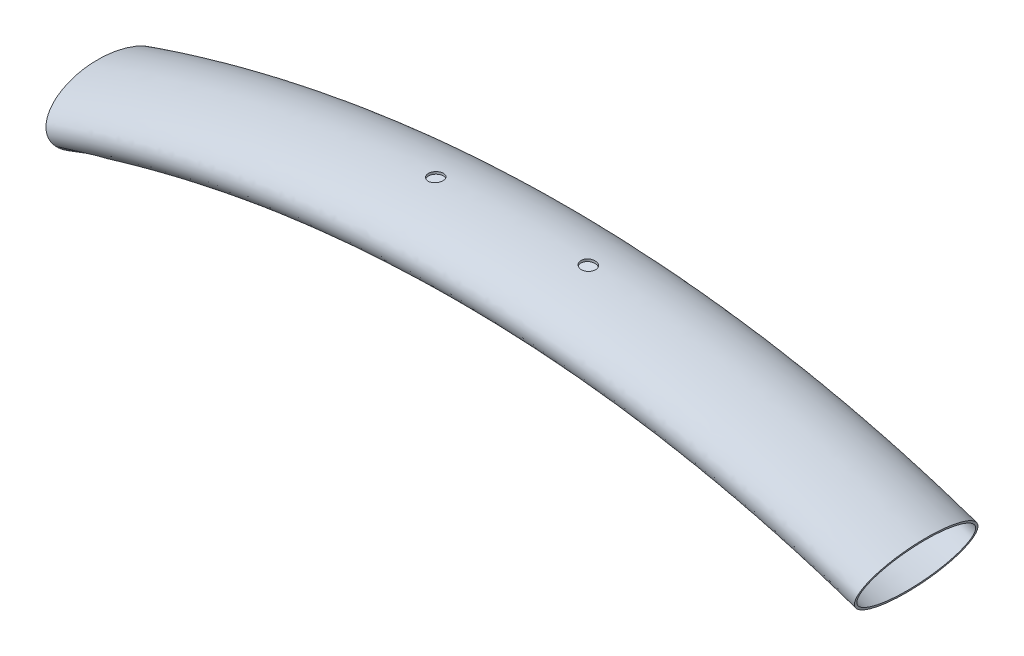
ISO-10303-21;
HEADER;
FILE_DESCRIPTION(('STEP AP214'),'2;1');
FILE_NAME('part.step','',(''),(''),'','','');
FILE_SCHEMA(('AUTOMOTIVE_DESIGN { 1 0 10303 214 1 1 1 1 }'));
ENDSEC;
DATA;
#1=APPLICATION_CONTEXT('core data for automotive mechanical design processes');
#2=APPLICATION_PROTOCOL_DEFINITION('international standard','automotive_design',2000,#1);
#3=PRODUCT_CONTEXT('',#1,'mechanical');
#4=PRODUCT('Part','Part','',(#3));
#5=PRODUCT_RELATED_PRODUCT_CATEGORY('part','',(#4));
#6=PRODUCT_DEFINITION_FORMATION('','',#4);
#7=PRODUCT_DEFINITION_CONTEXT('part definition',#1,'design');
#8=PRODUCT_DEFINITION('design','',#6,#7);
#9=PRODUCT_DEFINITION_SHAPE('','',#8);
#10=(LENGTH_UNIT() NAMED_UNIT(*) SI_UNIT(.MILLI.,.METRE.));
#11=(NAMED_UNIT(*) PLANE_ANGLE_UNIT() SI_UNIT($,.RADIAN.));
#12=(NAMED_UNIT(*) SI_UNIT($,.STERADIAN.) SOLID_ANGLE_UNIT());
#13=UNCERTAINTY_MEASURE_WITH_UNIT(LENGTH_MEASURE(1.E-05),#10,'distance_accuracy_value','');
#14=(GEOMETRIC_REPRESENTATION_CONTEXT(3) GLOBAL_UNCERTAINTY_ASSIGNED_CONTEXT((#13)) GLOBAL_UNIT_ASSIGNED_CONTEXT((#10,
#11,#12)) REPRESENTATION_CONTEXT('',''));
#15=CARTESIAN_POINT('',(0.,0.,0.));
#16=DIRECTION('',(0.,0.,1.));
#17=DIRECTION('',(1.,0.,0.));
#18=AXIS2_PLACEMENT_3D('',#15,#16,#17);
#19=CARTESIAN_POINT('',(-265.,1161.52496786,0.));
#20=DIRECTION('',(-0.945209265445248,-0.326465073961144,0.));
#21=DIRECTION('',(0.,0.,1.));
#22=AXIS2_PLACEMENT_3D('',#19,#20,#21);
#23=ELLIPSE('',#22,40.,20.);
#24=CARTESIAN_POINT('',(0.,394.274577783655,0.));
#25=DIRECTION('',(0.,0.,-1.));
#26=AXIS1_PLACEMENT('',#24,#25);
#27=SURFACE_OF_REVOLUTION('',#23,#26);
#28=CARTESIAN_POINT('',(-50.,1184.5613917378,4.75000000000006));
#29=CARTESIAN_POINT('',(-49.7337968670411,1184.57823184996,4.74998848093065));
#30=CARTESIAN_POINT('',(-49.4673184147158,1184.59360176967,4.72754798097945));
#31=CARTESIAN_POINT('',(-48.9415224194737,1184.62106452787,4.63825218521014));
#32=CARTESIAN_POINT('',(-48.6822131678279,1184.63315370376,4.57134753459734));
#33=CARTESIAN_POINT('',(-48.1784495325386,1184.65405635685,4.39495389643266));
#34=CARTESIAN_POINT('',(-47.9339896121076,1184.66287106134,4.28548089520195));
#35=CARTESIAN_POINT('',(-47.4668986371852,1184.67753722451,4.02705007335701));
#36=CARTESIAN_POINT('',(-47.2442626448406,1184.68338935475,3.87810121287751));
#37=CARTESIAN_POINT('',(-46.8272995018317,1184.69265849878,3.54508036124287));
#38=CARTESIAN_POINT('',(-46.6329468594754,1184.69607771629,3.36104034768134));
#39=CARTESIAN_POINT('',(-46.2778340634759,1184.70113905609,2.96295940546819));
#40=CARTESIAN_POINT('',(-46.1170751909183,1184.70278111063,2.74891733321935));
#41=CARTESIAN_POINT('',(-45.8336402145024,1184.70495667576,2.29677563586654));
#42=CARTESIAN_POINT('',(-45.710985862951,1184.70548955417,2.05866237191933));
#43=CARTESIAN_POINT('',(-45.5073638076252,1184.70603373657,1.5652329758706));
#44=CARTESIAN_POINT('',(-45.4263961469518,1184.70604504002,1.30991682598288));
#45=CARTESIAN_POINT('',(-45.3084067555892,1184.70597158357,0.78915982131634));
#46=CARTESIAN_POINT('',(-45.2714118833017,1184.70588676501,0.523712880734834));
#47=CARTESIAN_POINT('',(-45.2425081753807,1184.70582531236,-0.00962402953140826));
#48=CARTESIAN_POINT('',(-45.250599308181,1184.70584867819,-0.277513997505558));
#49=CARTESIAN_POINT('',(-45.311640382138,1184.70595839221,-0.808156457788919));
#50=CARTESIAN_POINT('',(-45.3645941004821,1184.7060447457,-1.07090851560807));
#51=CARTESIAN_POINT('',(-45.5138624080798,1184.70599168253,-1.58379379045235));
#52=CARTESIAN_POINT('',(-45.6101771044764,1184.7058522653,-1.83392697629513));
#53=CARTESIAN_POINT('',(-45.8434316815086,1184.70485438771,-2.31446996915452));
#54=CARTESIAN_POINT('',(-45.98037114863,1184.70399593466,-2.54487997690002));
#55=CARTESIAN_POINT('',(-46.2909838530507,1184.70093032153,-2.979434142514));
#56=CARTESIAN_POINT('',(-46.4646569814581,1184.69872316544,-3.18357837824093));
#57=CARTESIAN_POINT('',(-46.8437212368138,1184.69228548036,-3.55972926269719));
#58=CARTESIAN_POINT('',(-47.0491005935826,1184.688055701,-3.73174778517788));
#59=CARTESIAN_POINT('',(-47.4857629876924,1184.67695429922,-4.03885604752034));
#60=CARTESIAN_POINT('',(-47.7170457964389,1184.67008270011,-4.17394611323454));
#61=CARTESIAN_POINT('',(-48.1987088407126,1184.65324471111,-4.40328769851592));
#62=CARTESIAN_POINT('',(-48.4490735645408,1184.64328081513,-4.497571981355));
#63=CARTESIAN_POINT('',(-48.9619166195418,1184.62004541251,-4.64283436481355));
#64=CARTESIAN_POINT('',(-49.2243949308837,1184.60677391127,-4.69381253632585));
#65=CARTESIAN_POINT('',(-49.7541172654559,1184.57701556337,-4.75111005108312));
#66=CARTESIAN_POINT('',(-50.0213633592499,1184.56052728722,-4.75740949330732));
#67=CARTESIAN_POINT('',(-50.5529545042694,1184.52477520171,-4.72521456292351));
#68=CARTESIAN_POINT('',(-50.8172994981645,1184.50551133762,-4.68671930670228));
#69=CARTESIAN_POINT('',(-51.3365123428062,1184.46490326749,-4.56590709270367));
#70=CARTESIAN_POINT('',(-51.5913469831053,1184.44355257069,-4.48344961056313));
#71=CARTESIAN_POINT('',(-52.0835081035,1184.39986868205,-4.27699787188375));
#72=CARTESIAN_POINT('',(-52.3208340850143,1184.37753546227,-4.15300243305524));
#73=CARTESIAN_POINT('',(-52.7721971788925,1184.33304780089,-3.86641360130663));
#74=CARTESIAN_POINT('',(-52.9861435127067,1184.31089434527,-3.70367704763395));
#75=CARTESIAN_POINT('',(-53.3836712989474,1184.26820956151,-3.34440490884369));
#76=CARTESIAN_POINT('',(-53.5672526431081,1184.24767823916,-3.14786920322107));
#77=CARTESIAN_POINT('',(-53.898700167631,1184.20959019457,-2.7266136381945));
#78=CARTESIAN_POINT('',(-54.0465867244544,1184.19203177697,-2.50190997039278));
#79=CARTESIAN_POINT('',(-54.3024635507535,1184.16107882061,-2.03056832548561));
#80=CARTESIAN_POINT('',(-54.4104553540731,1184.14768412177,-1.78393119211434));
#81=CARTESIAN_POINT('',(-54.5827991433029,1184.12607607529,-1.27733917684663));
#82=CARTESIAN_POINT('',(-54.6474161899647,1184.1178312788,-1.01747582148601));
#83=CARTESIAN_POINT('',(-54.7321397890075,1184.10698581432,-0.490479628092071));
#84=CARTESIAN_POINT('',(-54.7522481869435,1184.1043849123,-0.223347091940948));
#85=CARTESIAN_POINT('',(-54.747367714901,1184.10501357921,0.308790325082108));
#86=CARTESIAN_POINT('',(-54.7226651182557,1184.10820613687,0.573797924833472));
#87=CARTESIAN_POINT('',(-54.6294594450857,1184.12012001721,1.09586256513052));
#88=CARTESIAN_POINT('',(-54.5609565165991,1184.1288413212,1.35291963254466));
#89=CARTESIAN_POINT('',(-54.3821775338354,1184.15119429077,1.85181956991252));
#90=CARTESIAN_POINT('',(-54.2719037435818,1184.16482569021,2.09366326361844));
#91=CARTESIAN_POINT('',(-54.0127814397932,1184.19605710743,2.55542174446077));
#92=CARTESIAN_POINT('',(-53.8639330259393,1184.21365711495,2.77533658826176));
#93=CARTESIAN_POINT('',(-53.5308581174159,1184.25177161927,3.18847650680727));
#94=CARTESIAN_POINT('',(-53.346419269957,1184.27230340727,3.38152876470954));
#95=CARTESIAN_POINT('',(-52.9479036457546,1184.31488708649,3.73405266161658));
#96=CARTESIAN_POINT('',(-52.733818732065,1184.33693939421,3.89351505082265));
#97=CARTESIAN_POINT('',(-52.2805160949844,1184.38137966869,4.17534173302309));
#98=CARTESIAN_POINT('',(-52.0411390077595,1184.40376889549,4.29744928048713));
#99=CARTESIAN_POINT('',(-51.5453487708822,1184.44746891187,4.49954484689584));
#100=CARTESIAN_POINT('',(-51.2889554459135,1184.46878090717,4.57958094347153));
#101=CARTESIAN_POINT('',(-50.8592150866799,1184.50210399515,4.67483924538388));
#102=CARTESIAN_POINT('',(-50.6886702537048,1184.51473273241,4.70298153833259));
#103=CARTESIAN_POINT('',(-50.3454556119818,1184.5389113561,4.74056566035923));
#104=CARTESIAN_POINT('',(-50.1727858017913,1184.55046124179,4.75000747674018));
#105=CARTESIAN_POINT('',(-50.,1184.5613917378,4.75000000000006));
#106=B_SPLINE_CURVE_WITH_KNOTS('',3,(#28,#29,#30,#31,#32,#33,#34,#35,#36,#37,#38,#39,#40,#41,
#42,#43,#44,#45,#46,#47,#48,#49,#50,#51,#52,#53,#54,#55,#56,#57,#58,#59,#60,#61,#62,#63,#64,#65,
#66,#67,#68,#69,#70,#71,#72,#73,#74,#75,#76,#77,#78,#79,#80,#81,#82,#83,#84,#85,#86,#87,#88,#89,
#90,#91,#92,#93,#94,#95,#96,#97,#98,#99,#100,#101,#102,#103,#104,#105),.UNSPECIFIED.,.T.,.F.,(4,
2,2,2,2,2,2,2,2,2,2,2,2,2,2,2,2,2,2,2,2,2,2,2,2,2,2,2,2,2,2,2,2,2,2,2,2,2,4),(0.,
0.799577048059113,1.60004310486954,2.40020884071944,3.20019311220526,3.99945183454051,
4.79874103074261,5.59848567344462,6.39823114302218,7.19846484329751,7.998697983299,
8.79899850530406,9.59930100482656,10.3995953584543,11.199887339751,11.9998829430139,
12.7998714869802,13.5992165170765,14.3985602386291,15.1982599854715,15.9979755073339,
16.8002627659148,17.6025728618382,18.4078950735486,19.2132201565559,20.0180844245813,
20.8229177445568,21.6227868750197,22.4226228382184,23.2173670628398,24.0121086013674,
24.8068070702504,25.6015034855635,26.4010969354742,27.2009102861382,28.0061033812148,
28.8103743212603,29.3293594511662,29.848344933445),.UNSPECIFIED.);
#107=CARTESIAN_POINT('',(-50.,1184.5613917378,4.75000000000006));
#108=VERTEX_POINT('',#107);
#109=EDGE_CURVE('E43',#108,#108,#106,.T.);
#110=ORIENTED_EDGE('',*,*,#109,.T.);
#111=EDGE_LOOP('',(#110));
#112=FACE_BOUND('',#111,.T.);
#113=CARTESIAN_POINT('',(-50.,1224.35396711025,4.75000000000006));
#114=CARTESIAN_POINT('',(-50.2664172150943,1224.33792113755,4.74998840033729));
#115=CARTESIAN_POINT('',(-50.5330928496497,1224.32308328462,4.72751169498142));
#116=CARTESIAN_POINT('',(-51.0592423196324,1224.29616397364,4.63808860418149));
#117=CARTESIAN_POINT('',(-51.3187076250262,1224.28408566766,4.57109170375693));
#118=CARTESIAN_POINT('',(-51.8227381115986,1224.26274673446,4.3944712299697));
#119=CARTESIAN_POINT('',(-52.0673090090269,1224.25348502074,4.28486413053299));
#120=CARTESIAN_POINT('',(-52.5345794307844,1224.23757835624,4.02612996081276));
#121=CARTESIAN_POINT('',(-52.7572840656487,1224.23093279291,3.87701215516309));
#122=CARTESIAN_POINT('',(-53.1743338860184,1224.21987669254,3.5436285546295));
#123=CARTESIAN_POINT('',(-53.3687055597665,1224.21546405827,3.35939596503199));
#124=CARTESIAN_POINT('',(-53.7238076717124,1224.20837565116,2.9609090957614));
#125=CARTESIAN_POINT('',(-53.8845368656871,1224.20569994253,2.74665370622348));
#126=CARTESIAN_POINT('',(-54.16779122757,1224.20157392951,2.29418077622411));
#127=CARTESIAN_POINT('',(-54.2903121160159,1224.20012376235,2.05596055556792));
#128=CARTESIAN_POINT('',(-54.4936461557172,1224.19799529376,1.56233698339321));
#129=CARTESIAN_POINT('',(-54.5744593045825,1224.19731699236,1.30693363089));
#130=CARTESIAN_POINT('',(-54.692109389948,1224.19640265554,0.786079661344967));
#131=CARTESIAN_POINT('',(-54.7289281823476,1224.19616680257,0.520624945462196));
#132=CARTESIAN_POINT('',(-54.7574836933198,1224.19597990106,-0.0126980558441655));
#133=CARTESIAN_POINT('',(-54.7492204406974,1224.19602885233,-0.280566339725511));
#134=CARTESIAN_POINT('',(-54.6878427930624,1224.19644746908,-0.811146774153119));
#135=CARTESIAN_POINT('',(-54.6347230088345,1224.19681717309,-1.07385830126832));
#136=CARTESIAN_POINT('',(-54.4851333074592,1224.19810223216,-1.58663427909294));
#137=CARTESIAN_POINT('',(-54.3886633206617,1224.19901758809,-1.83669870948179));
#138=CARTESIAN_POINT('',(-54.1551186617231,1224.20177619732,-2.31706939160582));
#139=CARTESIAN_POINT('',(-54.0180456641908,1224.20361941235,-2.54737645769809));
#140=CARTESIAN_POINT('',(-53.7071919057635,1224.20871826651,-2.98170162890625));
#141=CARTESIAN_POINT('',(-53.5334112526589,1224.21197390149,-3.18571981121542));
#142=CARTESIAN_POINT('',(-53.1541504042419,1224.22041010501,-3.56161440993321));
#143=CARTESIAN_POINT('',(-52.9486798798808,1224.22559008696,-3.73350059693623));
#144=CARTESIAN_POINT('',(-52.5118619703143,1224.23833473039,-4.04033260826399));
#145=CARTESIAN_POINT('',(-52.2805147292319,1224.24589937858,-4.17527863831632));
#146=CARTESIAN_POINT('',(-51.7986429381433,1224.26373296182,-4.40437594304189));
#147=CARTESIAN_POINT('',(-51.5481259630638,1224.27400083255,-4.49854323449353));
#148=CARTESIAN_POINT('',(-51.0349759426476,1224.29735705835,-4.64353445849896));
#149=CARTESIAN_POINT('',(-50.7723428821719,1224.31044541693,-4.69435833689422));
#150=CARTESIAN_POINT('',(-50.2422246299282,1224.33931046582,-4.75131013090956));
#151=CARTESIAN_POINT('',(-49.9747359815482,1224.35508914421,-4.75740484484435));
#152=CARTESIAN_POINT('',(-49.4426606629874,1224.38890587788,-4.72471376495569));
#153=CARTESIAN_POINT('',(-49.1780740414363,1224.40694397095,-4.68592722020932));
#154=CARTESIAN_POINT('',(-48.6585444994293,1224.44464012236,-4.56446634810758));
#155=CARTESIAN_POINT('',(-48.4036292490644,1224.46430238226,-4.48167497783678));
#156=CARTESIAN_POINT('',(-47.9113524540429,1224.50428232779,-4.27450227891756));
#157=CARTESIAN_POINT('',(-47.6739912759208,1224.52460002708,-4.15012008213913));
#158=CARTESIAN_POINT('',(-47.2228823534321,1224.56486190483,-3.86287572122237));
#159=CARTESIAN_POINT('',(-47.009199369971,1224.58480494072,-3.69991167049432));
#160=CARTESIAN_POINT('',(-46.6122353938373,1224.62309547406,-3.34025207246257));
#161=CARTESIAN_POINT('',(-46.4289544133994,1224.64144297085,-3.14355651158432));
#162=CARTESIAN_POINT('',(-46.0981837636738,1224.67538517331,-2.72213494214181));
#163=CARTESIAN_POINT('',(-45.9506637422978,1224.69098221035,-2.49743295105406));
#164=CARTESIAN_POINT('',(-45.6954989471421,1224.71842555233,-2.02621626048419));
#165=CARTESIAN_POINT('',(-45.5878529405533,1224.73027197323,-1.77970223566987));
#166=CARTESIAN_POINT('',(-45.4160368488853,1224.74936781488,-1.2731657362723));
#167=CARTESIAN_POINT('',(-45.351652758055,1224.75663985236,-1.01321670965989));
#168=CARTESIAN_POINT('',(-45.2674087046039,1224.76618321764,-0.486113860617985));
#169=CARTESIAN_POINT('',(-45.2475473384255,1224.76845470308,-0.218960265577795));
#170=CARTESIAN_POINT('',(-45.2529236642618,1224.76784216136,0.313567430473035));
#171=CARTESIAN_POINT('',(-45.2779401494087,1224.76498342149,0.578943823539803));
#172=CARTESIAN_POINT('',(-45.3719023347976,1224.75435522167,1.10169725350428));
#173=CARTESIAN_POINT('',(-45.4408479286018,1224.7465857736,1.35907430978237));
#174=CARTESIAN_POINT('',(-45.6206474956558,1224.72666086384,1.85855462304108));
#175=CARTESIAN_POINT('',(-45.7315006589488,1224.71450548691,2.1006581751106));
#176=CARTESIAN_POINT('',(-45.9919115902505,1224.68661041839,2.5628271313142));
#177=CARTESIAN_POINT('',(-46.1414689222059,1224.67087076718,2.78289278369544));
#178=CARTESIAN_POINT('',(-46.4758358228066,1224.63672753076,3.19588739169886));
#179=CARTESIAN_POINT('',(-46.6608095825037,1224.61831163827,3.38868238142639));
#180=CARTESIAN_POINT('',(-47.0603765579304,1224.57999471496,3.74058802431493));
#181=CARTESIAN_POINT('',(-47.2749777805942,1224.56009328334,3.89968954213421));
#182=CARTESIAN_POINT('',(-47.7289745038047,1224.51984365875,4.18050288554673));
#183=CARTESIAN_POINT('',(-47.9684997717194,1224.49949361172,4.3020044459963));
#184=CARTESIAN_POINT('',(-48.464441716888,1224.45955039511,4.50288589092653));
#185=CARTESIAN_POINT('',(-48.720838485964,1224.43995637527,4.58231445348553));
#186=CARTESIAN_POINT('',(-49.1489808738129,1224.4091970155,4.67627796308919));
#187=CARTESIAN_POINT('',(-49.3179352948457,1224.39753881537,4.70388347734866));
#188=CARTESIAN_POINT('',(-49.6578909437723,1224.3750766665,4.74074823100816));
#189=CARTESIAN_POINT('',(-49.8288921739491,1224.36427271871,4.75000744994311));
#190=CARTESIAN_POINT('',(-50.,1224.35396711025,4.75000000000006));
#191=B_SPLINE_CURVE_WITH_KNOTS('',3,(#113,#114,#115,#116,#117,#118,#119,#120,#121,#122,#123,
#124,#125,#126,#127,#128,#129,#130,#131,#132,#133,#134,#135,#136,#137,#138,#139,#140,#141,#142,
#143,#144,#145,#146,#147,#148,#149,#150,#151,#152,#153,#154,#155,#156,#157,#158,#159,#160,#161,
#162,#163,#164,#165,#166,#167,#168,#169,#170,#171,#172,#173,#174,#175,#176,#177,#178,#179,#180,
#181,#182,#183,#184,#185,#186,#187,#188,#189,#190),.UNSPECIFIED.,.T.,.F.,(4,2,2,2,2,2,2,2,2,2,2,
2,2,2,2,2,2,2,2,2,2,2,2,2,2,2,2,2,2,2,2,2,2,2,2,2,2,2,4),(0.,0.800076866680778,1.60106309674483,
2.40173995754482,3.20222923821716,4.00196528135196,4.80173089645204,5.6015860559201,
6.40144126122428,7.20162622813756,8.00181068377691,8.80209128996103,9.602373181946,
10.402622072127,11.2028686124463,12.0028714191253,12.8028697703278,13.6025536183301,
14.402238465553,15.2025168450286,16.0028086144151,16.8052397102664,17.6076875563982,
18.4122786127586,19.2168699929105,20.0207760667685,20.8246572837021,21.6245320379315,
22.424381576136,23.2202994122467,24.0162153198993,24.8121158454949,25.6080074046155,
26.4076822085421,27.207573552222,28.0118603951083,28.8152146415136,29.3290675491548,
29.8429210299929),.UNSPECIFIED.);
#192=CARTESIAN_POINT('',(-50.,1224.35396711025,4.75000000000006));
#193=VERTEX_POINT('',#192);
#194=EDGE_CURVE('E122',#193,#193,#191,.T.);
#195=ORIENTED_EDGE('',*,*,#194,.T.);
#196=EDGE_LOOP('',(#195));
#197=FACE_BOUND('',#196,.T.);
#198=CARTESIAN_POINT('',(50.,1184.5613917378,4.75000000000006));
#199=CARTESIAN_POINT('',(50.1338434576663,1184.55292389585,4.75000101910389));
#200=CARTESIAN_POINT('',(50.2676466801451,1184.54408433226,4.74434064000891));
#201=CARTESIAN_POINT('',(50.5342958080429,1184.52572934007,4.72175085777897));
#202=CARTESIAN_POINT('',(50.6671414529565,1184.51621373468,4.70481849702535));
#203=CARTESIAN_POINT('',(50.9310034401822,1184.49659268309,4.65979216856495));
#204=CARTESIAN_POINT('',(51.0620180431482,1184.4864867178,4.63168824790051));
#205=CARTESIAN_POINT('',(51.3212195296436,1184.46580018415,4.5645163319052));
#206=CARTESIAN_POINT('',(51.4494053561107,1184.45521944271,4.5254443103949));
#207=CARTESIAN_POINT('',(51.7018699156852,1184.43372594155,4.43666839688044));
#208=CARTESIAN_POINT('',(51.8261523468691,1184.42281351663,4.38697493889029));
#209=CARTESIAN_POINT('',(52.070112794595,1184.40078537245,4.27726870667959));
#210=CARTESIAN_POINT('',(52.189789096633,1184.38966957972,4.21725213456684));
#211=CARTESIAN_POINT('',(52.4235769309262,1184.36739982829,4.0873763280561));
#212=CARTESIAN_POINT('',(52.5376917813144,1184.3562458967,4.01752306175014));
#213=CARTESIAN_POINT('',(52.75967338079,1184.33405176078,3.86840886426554));
#214=CARTESIAN_POINT('',(52.8675378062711,1184.32301159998,3.78914446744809));
#215=CARTESIAN_POINT('',(53.0763883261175,1184.30119877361,3.62164106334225));
#216=CARTESIAN_POINT('',(53.1773625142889,1184.29042659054,3.5333871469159));
#217=CARTESIAN_POINT('',(53.3715504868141,1184.26933555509,3.34859937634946));
#218=CARTESIAN_POINT('',(53.4647613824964,1184.25901687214,3.2520624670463));
#219=CARTESIAN_POINT('',(53.6426829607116,1184.23900886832,3.05144726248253));
#220=CARTESIAN_POINT('',(53.7273964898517,1184.22931933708,2.94737151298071));
#221=CARTESIAN_POINT('',(53.8877764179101,1184.21072473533,2.73234164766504));
#222=CARTESIAN_POINT('',(53.9634394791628,1184.20181995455,2.62138501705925));
#223=CARTESIAN_POINT('',(54.1049179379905,1184.18497685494,2.39375294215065));
#224=CARTESIAN_POINT('',(54.1707620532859,1184.17703573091,2.2770955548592));
#225=CARTESIAN_POINT('',(54.2924112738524,1184.16222457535,2.0385384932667));
#226=CARTESIAN_POINT('',(54.3482126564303,1184.15535494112,1.91663689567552));
#227=CARTESIAN_POINT('',(54.4493114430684,1184.14281463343,1.66855064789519));
#228=CARTESIAN_POINT('',(54.4946131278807,1184.13714347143,1.54236776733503));
#229=CARTESIAN_POINT('',(54.5744178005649,1184.12709642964,1.28653272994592));
#230=CARTESIAN_POINT('',(54.608916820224,1184.12272102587,1.15687931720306));
#231=CARTESIAN_POINT('',(54.6666155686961,1184.1153757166,0.896045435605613));
#232=CARTESIAN_POINT('',(54.6898973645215,1184.11239560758,0.764883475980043));
#233=CARTESIAN_POINT('',(54.7253805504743,1184.10784419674,0.501031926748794));
#234=CARTESIAN_POINT('',(54.7375778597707,1184.10627341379,0.36834179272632));
#235=CARTESIAN_POINT('',(54.7573348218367,1184.10373183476,-0.0304870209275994));
#236=CARTESIAN_POINT('',(54.7481243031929,1184.10492345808,-0.297678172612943));
#237=CARTESIAN_POINT('',(54.6852774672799,1184.11299069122,-0.82523394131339));
#238=CARTESIAN_POINT('',(54.6318554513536,1184.11983888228,-1.08562525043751));
#239=CARTESIAN_POINT('',(54.4824728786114,1184.13869127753,-1.59374390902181));
#240=CARTESIAN_POINT('',(54.3865118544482,1184.15069553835,-1.84147111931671));
#241=CARTESIAN_POINT('',(54.1545606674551,1184.17905951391,-2.31786544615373));
#242=CARTESIAN_POINT('',(54.0184751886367,1184.19542959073,-2.54648549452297));
#243=CARTESIAN_POINT('',(53.7102638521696,1184.23140321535,-2.97769705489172));
#244=CARTESIAN_POINT('',(53.5381365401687,1184.25100689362,-3.18028751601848));
#245=CARTESIAN_POINT('',(53.161341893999,1184.29232403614,-3.55521485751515));
#246=CARTESIAN_POINT('',(52.9564524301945,1184.3140514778,-3.72732697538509));
#247=CARTESIAN_POINT('',(52.5207737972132,1184.35815157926,-4.03475991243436));
#248=CARTESIAN_POINT('',(52.2899838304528,1184.38052425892,-4.17007959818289));
#249=CARTESIAN_POINT('',(51.8077762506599,1184.42474025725,-4.40070589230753));
#250=CARTESIAN_POINT('',(51.5562646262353,1184.44658050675,-4.49581661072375));
#251=CARTESIAN_POINT('',(51.0406764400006,1184.48849255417,-4.64233949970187));
#252=CARTESIAN_POINT('',(50.7765999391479,1184.50856436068,-4.69375188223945));
#253=CARTESIAN_POINT('',(50.2436590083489,1184.54605594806,-4.75130353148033));
#254=CARTESIAN_POINT('',(49.9748000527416,1184.56347856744,-4.75749159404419));
#255=CARTESIAN_POINT('',(49.4396991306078,1184.59515855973,-4.72444854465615));
#256=CARTESIAN_POINT('',(49.1734571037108,1184.60941600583,-4.6852184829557));
#257=CARTESIAN_POINT('',(48.6523135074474,1184.63452202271,-4.56263141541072));
#258=CARTESIAN_POINT('',(48.3973702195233,1184.64538422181,-4.47945452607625));
#259=CARTESIAN_POINT('',(47.9049855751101,1184.66391284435,-4.27139842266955));
#260=CARTESIAN_POINT('',(47.6675439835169,1184.67157931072,-4.14651976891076));
#261=CARTESIAN_POINT('',(47.217520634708,1184.68410552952,-3.85894314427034));
#262=CARTESIAN_POINT('',(47.0048802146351,1184.68897201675,-3.69633725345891));
#263=CARTESIAN_POINT('',(46.6098560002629,1184.69651232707,-3.33775162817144));
#264=CARTESIAN_POINT('',(46.4274722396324,1184.69918614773,-3.14177185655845));
#265=CARTESIAN_POINT('',(46.0981196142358,1184.70301044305,-2.72194904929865));
#266=CARTESIAN_POINT('',(45.9511566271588,1184.70416066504,-2.49810139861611));
#267=CARTESIAN_POINT('',(45.6968574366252,1184.70558601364,-2.02896508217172));
#268=CARTESIAN_POINT('',(45.5895213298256,1184.70586113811,-1.78367636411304));
#269=CARTESIAN_POINT('',(45.4174417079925,1184.70607387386,-1.27823253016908));
#270=CARTESIAN_POINT('',(45.3527304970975,1184.70601122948,-1.0180663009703));
#271=CARTESIAN_POINT('',(45.28909215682,1184.70591986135,-0.622706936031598));
#272=CARTESIAN_POINT('',(45.273451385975,1184.70588982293,-0.489996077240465));
#273=CARTESIAN_POINT('',(45.2533982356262,1184.70584922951,-0.223741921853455));
#274=CARTESIAN_POINT('',(45.2489817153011,1184.70583866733,-0.0901989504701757));
#275=CARTESIAN_POINT('',(45.2514134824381,1184.70584397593,0.176851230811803));
#276=CARTESIAN_POINT('',(45.2582681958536,1184.7058598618,0.31035837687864));
#277=CARTESIAN_POINT('',(45.2831968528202,1184.70590831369,0.576273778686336));
#278=CARTESIAN_POINT('',(45.3012666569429,1184.70594087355,0.708682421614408));
#279=CARTESIAN_POINT('',(45.3485033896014,1184.70599781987,0.971555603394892));
#280=CARTESIAN_POINT('',(45.3776744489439,1184.70602220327,1.10201939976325));
#281=CARTESIAN_POINT('',(45.4468925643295,1184.70602326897,1.35997765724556));
#282=CARTESIAN_POINT('',(45.4869356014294,1184.70599996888,1.48747319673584));
#283=CARTESIAN_POINT('',(45.5776357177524,1184.70585304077,1.73868772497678));
#284=CARTESIAN_POINT('',(45.6282969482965,1184.70572937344,1.8624052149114));
#285=CARTESIAN_POINT('',(45.739842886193,1184.70531765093,2.10508644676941));
#286=CARTESIAN_POINT('',(45.8007238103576,1184.70502965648,2.22405192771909));
#287=CARTESIAN_POINT('',(45.9323111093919,1184.70421603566,2.45647030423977));
#288=CARTESIAN_POINT('',(46.0030207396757,1184.70369033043,2.56992135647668));
#289=CARTESIAN_POINT('',(46.1537186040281,1184.70232174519,2.79042026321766));
#290=CARTESIAN_POINT('',(46.2337033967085,1184.70147898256,2.89747047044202));
#291=CARTESIAN_POINT('',(46.4024091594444,1184.69939285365,3.10445936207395));
#292=CARTESIAN_POINT('',(46.4911307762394,1184.69814945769,3.20439751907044));
#293=CARTESIAN_POINT('',(46.6766380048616,1184.69517874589,3.39640671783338));
#294=CARTESIAN_POINT('',(46.7734206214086,1184.69345160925,3.48848065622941));
#295=CARTESIAN_POINT('',(46.9744482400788,1184.68943091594,3.66420109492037));
#296=CARTESIAN_POINT('',(47.0786977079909,1184.68713701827,3.74784247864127));
#297=CARTESIAN_POINT('',(47.2938215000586,1184.6819090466,3.90601014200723));
#298=CARTESIAN_POINT('',(47.4046933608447,1184.67897520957,3.98053977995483));
#299=CARTESIAN_POINT('',(47.6323110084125,1184.67240062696,4.11999565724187));
#300=CARTESIAN_POINT('',(47.7490571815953,1184.66875983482,4.18492126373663));
#301=CARTESIAN_POINT('',(47.9875358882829,1184.66071915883,4.3046818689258));
#302=CARTESIAN_POINT('',(48.1092665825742,1184.65631955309,4.35952054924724));
#303=CARTESIAN_POINT('',(48.3567789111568,1184.64672538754,4.45870861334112));
#304=CARTESIAN_POINT('',(48.482556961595,1184.64153151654,4.50306700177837));
#305=CARTESIAN_POINT('',(48.7373213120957,1184.63032664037,4.5810357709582));
#306=CARTESIAN_POINT('',(48.8663067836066,1184.62431584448,4.6146488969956));
#307=CARTESIAN_POINT('',(49.1612438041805,1184.60976316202,4.67839642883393));
#308=CARTESIAN_POINT('',(49.3279067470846,1184.6009732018,4.70523048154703));
#309=CARTESIAN_POINT('',(49.6630677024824,1184.58211563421,4.74103160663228));
#310=CARTESIAN_POINT('',(49.8315657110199,1184.57204802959,4.74999871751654));
#311=CARTESIAN_POINT('',(50.,1184.5613917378,4.75000000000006));
#312=B_SPLINE_CURVE_WITH_KNOTS('',3,(#198,#199,#200,#201,#202,#203,#204,#205,#206,#207,#208,
#209,#210,#211,#212,#213,#214,#215,#216,#217,#218,#219,#220,#221,#222,#223,#224,#225,#226,#227,
#228,#229,#230,#231,#232,#233,#234,#235,#236,#237,#238,#239,#240,#241,#242,#243,#244,#245,#246,
#247,#248,#249,#250,#251,#252,#253,#254,#255,#256,#257,#258,#259,#260,#261,#262,#263,#264,#265,
#266,#267,#268,#269,#270,#271,#272,#273,#274,#275,#276,#277,#278,#279,#280,#281,#282,#283,#284,
#285,#286,#287,#288,#289,#290,#291,#292,#293,#294,#295,#296,#297,#298,#299,#300,#301,#302,#303,
#304,#305,#306,#307,#308,#309,#310,#311),.UNSPECIFIED.,.T.,.F.,(4,2,2,2,2,2,2,2,2,2,2,2,2,2,2,2,
2,2,2,2,2,2,2,2,2,2,2,2,2,2,2,2,2,2,2,2,2,2,2,2,2,2,2,2,2,2,2,2,2,2,2,2,2,2,2,2,4),(0.,
0.40218489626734,0.80447536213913,1.20712504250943,1.60992272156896,2.0123265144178,
2.41487867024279,2.81718763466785,3.21964521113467,3.62278148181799,4.02606709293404,
4.4292171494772,4.83251542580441,5.23461000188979,5.63685332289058,6.03893235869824,
6.44115891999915,6.84039627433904,7.23978055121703,8.03765691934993,8.83168832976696,
9.62572846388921,10.4216702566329,11.2176441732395,12.01926348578,12.8209074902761,
13.6264131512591,14.4319149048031,15.236547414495,16.041161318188,16.8425027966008,
17.6438335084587,18.4432286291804,19.2426246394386,20.0421532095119,20.8416837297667,
21.6418194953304,22.0423182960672,22.4426693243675,22.8432486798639,23.2436802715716,
23.6442610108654,24.0446938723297,24.4452835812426,24.845725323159,25.246300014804,
25.6467265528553,26.0471827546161,26.4474908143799,26.8480403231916,27.2484417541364,
27.6488695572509,28.0491509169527,28.4490870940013,28.8489210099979,29.3550486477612,
29.8611751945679),.UNSPECIFIED.);
#313=CARTESIAN_POINT('',(50.,1184.5613917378,4.75000000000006));
#314=VERTEX_POINT('',#313);
#315=EDGE_CURVE('E71',#314,#314,#312,.T.);
#316=ORIENTED_EDGE('',*,*,#315,.T.);
#317=EDGE_LOOP('',(#316));
#318=FACE_BOUND('',#317,.T.);
#319=CARTESIAN_POINT('',(50.,1224.35396711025,4.75000000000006));
#320=CARTESIAN_POINT('',(49.8662001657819,1224.36202641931,4.75000098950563));
#321=CARTESIAN_POINT('',(49.7324350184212,1224.37039080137,4.74434431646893));
#322=CARTESIAN_POINT('',(49.465850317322,1224.38766703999,4.72176647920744));
#323=CARTESIAN_POINT('',(49.3330310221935,1224.3965790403,4.70484234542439));
#324=CARTESIAN_POINT('',(49.0692090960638,1224.41487272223,4.65983401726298));
#325=CARTESIAN_POINT('',(48.9382082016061,1224.42425481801,4.63173982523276));
#326=CARTESIAN_POINT('',(48.6790230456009,1224.44338568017,4.56458623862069));
#327=CARTESIAN_POINT('',(48.5508398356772,1224.45313457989,4.52552282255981));
#328=CARTESIAN_POINT('',(48.2983661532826,1224.47287325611,4.43675909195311));
#329=CARTESIAN_POINT('',(48.1740721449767,1224.4828627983,4.38706878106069));
#330=CARTESIAN_POINT('',(47.9300825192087,1224.50297061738,4.27736363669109));
#331=CARTESIAN_POINT('',(47.8103886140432,1224.51308894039,4.21734500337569));
#332=CARTESIAN_POINT('',(47.5765635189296,1224.53331038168,4.08746019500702));
#333=CARTESIAN_POINT('',(47.4624289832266,1224.54341350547,4.01760004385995));
#334=CARTESIAN_POINT('',(47.2404085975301,1224.56347387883,3.8684680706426));
#335=CARTESIAN_POINT('',(47.1325250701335,1224.57343107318,3.78919278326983));
#336=CARTESIAN_POINT('',(46.9237114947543,1224.59306108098,3.62172323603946));
#337=CARTESIAN_POINT('',(46.8227885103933,1224.6027336,3.53352013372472));
#338=CARTESIAN_POINT('',(46.6286974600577,1224.62164162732,3.34884602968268));
#339=CARTESIAN_POINT('',(46.5355322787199,1224.63087697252,3.25237197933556));
#340=CARTESIAN_POINT('',(46.357696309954,1224.64876028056,3.05189642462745));
#341=CARTESIAN_POINT('',(46.2730226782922,1224.65740843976,2.94789746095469));
#342=CARTESIAN_POINT('',(46.1127153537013,1224.67398595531,2.73303685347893));
#343=CARTESIAN_POINT('',(46.03708499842,1224.68191504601,2.62217269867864));
#344=CARTESIAN_POINT('',(45.8956459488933,1224.69690074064,2.394715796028));
#345=CARTESIAN_POINT('',(45.8298107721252,1224.70395968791,2.27813967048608));
#346=CARTESIAN_POINT('',(45.7081713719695,1224.71711612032,2.03975956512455));
#347=CARTESIAN_POINT('',(45.6523708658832,1224.72321324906,1.91795366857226));
#348=CARTESIAN_POINT('',(45.5512618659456,1224.73433800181,1.67007125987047));
#349=CARTESIAN_POINT('',(45.5059491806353,1224.73936605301,1.54399647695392));
#350=CARTESIAN_POINT('',(45.4261075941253,1224.74827178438,1.28838867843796));
#351=CARTESIAN_POINT('',(45.3915826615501,1224.75214904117,1.15885440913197));
#352=CARTESIAN_POINT('',(45.3337713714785,1224.75866400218,0.898071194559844));
#353=CARTESIAN_POINT('',(45.3104193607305,1224.76130894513,0.766837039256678));
#354=CARTESIAN_POINT('',(45.2748092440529,1224.76535010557,0.502839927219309));
#355=CARTESIAN_POINT('',(45.2625552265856,1224.76674586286,0.370076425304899));
#356=CARTESIAN_POINT('',(45.2426468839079,1224.76901123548,-0.0289782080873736));
#357=CARTESIAN_POINT('',(45.2517818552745,1224.76796629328,-0.296325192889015));
#358=CARTESIAN_POINT('',(45.3145694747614,1224.76083583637,-0.82451062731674));
#359=CARTESIAN_POINT('',(45.3680567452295,1224.75476904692,-1.085369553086));
#360=CARTESIAN_POINT('',(45.5177365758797,1224.73803509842,-1.59441338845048));
#361=CARTESIAN_POINT('',(45.6139294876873,1224.72736790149,-1.84259819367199));
#362=CARTESIAN_POINT('',(45.846453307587,1224.70211785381,-2.31972547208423));
#363=CARTESIAN_POINT('',(45.982857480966,1224.68752786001,-2.54863183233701));
#364=CARTESIAN_POINT('',(46.291830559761,1224.65538494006,-2.98034231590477));
#365=CARTESIAN_POINT('',(46.4644005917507,1224.63783192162,-3.18314562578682));
#366=CARTESIAN_POINT('',(46.841885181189,1224.6007478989,-3.55808512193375));
#367=CARTESIAN_POINT('',(47.046973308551,1224.5812064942,-3.73004553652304));
#368=CARTESIAN_POINT('',(47.4830238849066,1224.54138220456,-4.03713344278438));
#369=CARTESIAN_POINT('',(47.7139869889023,1224.52109930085,-4.17226000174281));
#370=CARTESIAN_POINT('',(48.196287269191,1224.48081904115,-4.40236211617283));
#371=CARTESIAN_POINT('',(48.4477022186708,1224.46082315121,-4.49717496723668));
#372=CARTESIAN_POINT('',(48.9630010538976,1224.4221829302,-4.64315010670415));
#373=CARTESIAN_POINT('',(49.226884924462,1224.40353859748,-4.69431244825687));
#374=CARTESIAN_POINT('',(49.7595204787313,1224.36837819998,-4.7514604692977));
#375=CARTESIAN_POINT('',(50.0282698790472,1224.35186116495,-4.75746681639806));
#376=CARTESIAN_POINT('',(50.5630885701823,1224.32144937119,-4.7241098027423));
#377=CARTESIAN_POINT('',(50.8291579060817,1224.30755456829,-4.68474720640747));
#378=CARTESIAN_POINT('',(51.3501930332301,1224.28264389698,-4.5618970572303));
#379=CARTESIAN_POINT('',(51.6051900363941,1224.27161942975,-4.47854361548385));
#380=CARTESIAN_POINT('',(52.0976348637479,1224.25234204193,-4.27011843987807));
#381=CARTESIAN_POINT('',(52.3350828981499,1224.24408908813,-4.14504720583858));
#382=CARTESIAN_POINT('',(52.7851381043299,1224.2300921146,-3.85703609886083));
#383=CARTESIAN_POINT('',(52.9977975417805,1224.22434274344,-3.69417814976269));
#384=CARTESIAN_POINT('',(53.3927998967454,1224.21489474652,-3.33506536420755));
#385=CARTESIAN_POINT('',(53.5751428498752,1224.21119611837,-3.13881056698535));
#386=CARTESIAN_POINT('',(53.9042789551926,1224.20534267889,-2.71851386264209));
#387=CARTESIAN_POINT('',(54.0510808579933,1224.2031874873,-2.49447881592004));
#388=CARTESIAN_POINT('',(54.3050193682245,1224.19992121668,-2.02498896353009));
#389=CARTESIAN_POINT('',(54.4121559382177,1224.19881013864,-1.77953413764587));
#390=CARTESIAN_POINT('',(54.5837725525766,1224.19721635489,-1.27386896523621));
#391=CARTESIAN_POINT('',(54.6482336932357,1224.19673392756,-1.01365213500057));
#392=CARTESIAN_POINT('',(54.7114948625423,1224.19628447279,-0.618248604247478));
#393=CARTESIAN_POINT('',(54.7270094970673,1224.19618037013,-0.485528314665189));
#394=CARTESIAN_POINT('',(54.7468104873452,1224.1960491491,-0.21926592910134));
#395=CARTESIAN_POINT('',(54.7511009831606,1224.19602200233,-0.0857241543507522));
#396=CARTESIAN_POINT('',(54.7484180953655,1224.19603943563,0.181313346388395));
#397=CARTESIAN_POINT('',(54.7414382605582,1224.19608405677,0.314809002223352));
#398=CARTESIAN_POINT('',(54.7162612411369,1224.19625277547,0.580690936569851));
#399=CARTESIAN_POINT('',(54.698068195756,1224.19637684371,0.713077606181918));
#400=CARTESIAN_POINT('',(54.6505876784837,1224.19672394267,0.975896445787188));
#401=CARTESIAN_POINT('',(54.6212960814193,1224.1969470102,1.10632787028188));
#402=CARTESIAN_POINT('',(54.5518406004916,1224.19752279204,1.36421122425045));
#403=CARTESIAN_POINT('',(54.5116807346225,1224.19787545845,1.49166423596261));
#404=CARTESIAN_POINT('',(54.4207515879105,1224.19875151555,1.74278360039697));
#405=CARTESIAN_POINT('',(54.369978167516,1224.19927497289,1.86644845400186));
#406=CARTESIAN_POINT('',(54.2582135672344,1224.20054198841,2.10901471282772));
#407=CARTESIAN_POINT('',(54.1972261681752,1224.20128546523,2.22791786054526));
#408=CARTESIAN_POINT('',(54.0654327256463,1224.20304936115,2.46020201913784));
#409=CARTESIAN_POINT('',(53.9946234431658,1224.20406987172,2.57358119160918));
#410=CARTESIAN_POINT('',(53.8437341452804,1224.20644860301,2.79392757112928));
#411=CARTESIAN_POINT('',(53.7636575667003,1224.20780669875,2.90089713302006));
#412=CARTESIAN_POINT('',(53.5947778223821,1224.21092457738,3.10771573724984));
#413=CARTESIAN_POINT('',(53.5059740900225,1224.21268438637,3.20756431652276));
#414=CARTESIAN_POINT('',(53.3203123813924,1224.21666851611,3.3993875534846));
#415=CARTESIAN_POINT('',(53.2234573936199,1224.21889266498,3.49136510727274));
#416=CARTESIAN_POINT('',(53.0222947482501,1224.22386822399,3.66688748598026));
#417=CARTESIAN_POINT('',(52.9179825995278,1224.22661995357,3.75042715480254));
#418=CARTESIAN_POINT('',(52.702743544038,1224.23270427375,3.90838721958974));
#419=CARTESIAN_POINT('',(52.5918190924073,1224.23603664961,3.9828109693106));
#420=CARTESIAN_POINT('',(52.3640697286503,1224.24333198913,4.12207434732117));
#421=CARTESIAN_POINT('',(52.2472425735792,1224.24729519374,4.18691029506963));
#422=CARTESIAN_POINT('',(52.0086074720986,1224.25588696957,4.30648363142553));
#423=CARTESIAN_POINT('',(51.8868013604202,1224.26051529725,4.36122469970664));
#424=CARTESIAN_POINT('',(51.6391441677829,1224.2704590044,4.46020988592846));
#425=CARTESIAN_POINT('',(51.5132966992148,1224.27577378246,4.50446309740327));
#426=CARTESIAN_POINT('',(51.2583974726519,1224.2871016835,4.58221459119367));
#427=CARTESIAN_POINT('',(51.1293465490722,1224.2931146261,4.61571564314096));
#428=CARTESIAN_POINT('',(50.835059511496,1224.30748947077,4.67903024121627));
#429=CARTESIAN_POINT('',(50.669131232,1224.31605582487,4.70562573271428));
#430=CARTESIAN_POINT('',(50.3354504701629,1224.33424407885,4.74110997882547));
#431=CARTESIAN_POINT('',(50.1676979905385,1224.34386597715,4.74999875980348));
#432=CARTESIAN_POINT('',(50.,1224.35396711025,4.75000000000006));
#433=B_SPLINE_CURVE_WITH_KNOTS('',3,(#319,#320,#321,#322,#323,#324,#325,#326,#327,#328,#329,
#330,#331,#332,#333,#334,#335,#336,#337,#338,#339,#340,#341,#342,#343,#344,#345,#346,#347,#348,
#349,#350,#351,#352,#353,#354,#355,#356,#357,#358,#359,#360,#361,#362,#363,#364,#365,#366,#367,
#368,#369,#370,#371,#372,#373,#374,#375,#376,#377,#378,#379,#380,#381,#382,#383,#384,#385,#386,
#387,#388,#389,#390,#391,#392,#393,#394,#395,#396,#397,#398,#399,#400,#401,#402,#403,#404,#405,
#406,#407,#408,#409,#410,#411,#412,#413,#414,#415,#416,#417,#418,#419,#420,#421,#422,#423,#424,
#425,#426,#427,#428,#429,#430,#431,#432),.UNSPECIFIED.,.T.,.F.,(4,2,2,2,2,2,2,2,2,2,2,2,2,2,2,2,
2,2,2,2,2,2,2,2,2,2,2,2,2,2,2,2,2,2,2,2,2,2,2,2,2,2,2,2,2,2,2,2,2,2,2,2,2,2,2,2,4),(0.,
0.401979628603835,0.804065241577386,1.20651155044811,1.60910559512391,2.0113223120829,
2.41368732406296,2.81580711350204,3.21807536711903,3.62074601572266,4.02356572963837,
4.42625006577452,4.82908256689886,5.23080535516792,5.63267665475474,6.03438706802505,
6.43624508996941,6.83571183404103,7.23532568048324,8.03366823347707,8.82904730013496,
9.62443291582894,10.4212767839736,11.2181454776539,12.0194203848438,12.8207155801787,
13.6252147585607,14.4297129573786,15.2338429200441,16.0379593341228,16.8396383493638,
17.6413077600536,18.4412550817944,19.2412014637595,20.0409506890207,20.8407006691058,
21.6408046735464,22.0412875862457,22.4416227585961,22.8421871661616,23.2426037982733,
23.643169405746,24.0435871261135,24.4441613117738,24.8445875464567,25.2451461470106,
25.6455566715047,26.0459932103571,26.4462817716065,26.8468134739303,27.2471973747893,
27.6477345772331,28.0481254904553,28.4481679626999,28.8481073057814,29.3519291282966,
29.8557502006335),.UNSPECIFIED.);
#434=CARTESIAN_POINT('',(50.,1224.35396711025,4.75000000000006));
#435=VERTEX_POINT('',#434);
#436=EDGE_CURVE('E66',#435,#435,#433,.T.);
#437=ORIENTED_EDGE('',*,*,#436,.T.);
#438=EDGE_LOOP('',(#437));
#439=FACE_BOUND('',#438,.T.);
#440=CARTESIAN_POINT('',(-265.,1161.52496786,40.0000000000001));
#441=VERTEX_POINT('',#440);
#442=EDGE_CURVE('E10',#441,#441,#23,.T.);
#443=ORIENTED_EDGE('',*,*,#442,.F.);
#444=EDGE_LOOP('',(#443));
#445=FACE_BOUND('',#444,.T.);
#446=CARTESIAN_POINT('',(265.,1161.52496786,0.));
#447=DIRECTION('',(-0.945209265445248,0.326465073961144,0.));
#448=DIRECTION('',(0.,0.,1.));
#449=AXIS2_PLACEMENT_3D('',#446,#447,#448);
#450=ELLIPSE('',#449,40.,20.);
#451=CARTESIAN_POINT('',(265.,1161.52496786,40.0000000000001));
#452=VERTEX_POINT('',#451);
#453=EDGE_CURVE('E27',#452,#452,#450,.T.);
#454=ORIENTED_EDGE('',*,*,#453,.T.);
#455=EDGE_LOOP('',(#454));
#456=FACE_BOUND('',#455,.T.);
#457=ADVANCED_FACE('F14',(#112,#197,#318,#439,#445,#456),#27,.T.);
#458=CARTESIAN_POINT('',(-265.,1161.52496786,0.));
#459=DIRECTION('',(-0.945209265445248,-0.326465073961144,0.));
#460=DIRECTION('',(0.326465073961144,-0.945209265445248,0.));
#461=AXIS2_PLACEMENT_3D('',#458,#459,#460);
#462=PLANE('',#461);
#463=CARTESIAN_POINT('',(-265.,1161.52496786,-38.5));
#464=CARTESIAN_POINT('',(-264.91378185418,1161.27534179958,-38.499998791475));
#465=CARTESIAN_POINT('',(-264.827560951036,1161.02570775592,-38.4876579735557));
#466=CARTESIAN_POINT('',(-264.655861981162,1160.52859039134,-38.4386824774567));
#467=CARTESIAN_POINT('',(-264.570383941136,1160.28110714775,-38.4020469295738));
#468=CARTESIAN_POINT('',(-264.400758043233,1159.7899919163,-38.3055341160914));
#469=CARTESIAN_POINT('',(-264.316611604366,1159.54636403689,-38.2456335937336));
#470=CARTESIAN_POINT('',(-264.150282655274,1159.0647944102,-38.1042286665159));
#471=CARTESIAN_POINT('',(-264.068100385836,1158.82685336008,-38.0227216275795));
#472=CARTESIAN_POINT('',(-263.886258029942,1158.30036800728,-37.817645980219));
#473=CARTESIAN_POINT('',(-263.78724796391,1158.01370569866,-37.6886648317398));
#474=CARTESIAN_POINT('',(-263.593393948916,1157.45244317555,-37.4041432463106));
#475=CARTESIAN_POINT('',(-263.498551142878,1157.17784627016,-37.2485955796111));
#476=CARTESIAN_POINT('',(-263.313119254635,1156.64096820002,-36.9144730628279));
#477=CARTESIAN_POINT('',(-263.222536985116,1156.37870675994,-36.7358629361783));
#478=CARTESIAN_POINT('',(-263.045818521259,1155.86705653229,-36.3592004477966));
#479=CARTESIAN_POINT('',(-262.959682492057,1155.61766822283,-36.1611473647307));
#480=CARTESIAN_POINT('',(-262.740867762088,1154.98413732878,-35.6234699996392));
#481=CARTESIAN_POINT('',(-262.61160554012,1154.60988642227,-35.2707672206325));
#482=CARTESIAN_POINT('',(-262.36355277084,1153.89170308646,-34.5323481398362));
#483=CARTESIAN_POINT('',(-262.244768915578,1153.54779003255,-34.1466110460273));
#484=CARTESIAN_POINT('',(-262.01667684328,1152.88739859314,-33.3487247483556));
#485=CARTESIAN_POINT('',(-261.907384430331,1152.57096596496,-32.9365334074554));
#486=CARTESIAN_POINT('',(-261.697622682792,1151.96364603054,-32.0915493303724));
#487=CARTESIAN_POINT('',(-261.597156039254,1151.67276651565,-31.6587503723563));
#488=CARTESIAN_POINT('',(-261.379303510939,1151.04202146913,-30.6623533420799));
#489=CARTESIAN_POINT('',(-261.264278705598,1150.70899193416,-30.0939208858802));
#490=CARTESIAN_POINT('',(-261.045621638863,1150.07591752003,-28.9364714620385));
#491=CARTESIAN_POINT('',(-260.941997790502,1149.77589699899,-28.3474397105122));
#492=CARTESIAN_POINT('',(-260.745089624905,1149.20579184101,-27.1532457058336));
#493=CARTESIAN_POINT('',(-260.651808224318,1148.93571564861,-26.5480789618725));
#494=CARTESIAN_POINT('',(-260.474540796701,1148.4224760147,-25.323887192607));
#495=CARTESIAN_POINT('',(-260.390571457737,1148.17936088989,-24.7048396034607));
#496=CARTESIAN_POINT('',(-260.231382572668,1147.71846377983,-23.4565951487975));
#497=CARTESIAN_POINT('',(-260.156159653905,1147.50067202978,-22.8274023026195));
#498=CARTESIAN_POINT('',(-260.01379162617,1147.08847608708,-21.5605074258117));
#499=CARTESIAN_POINT('',(-259.946646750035,1146.89407256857,-20.9228051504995));
#500=CARTESIAN_POINT('',(-259.82450670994,1146.54044240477,-19.6868816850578));
#501=CARTESIAN_POINT('',(-259.768983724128,1146.37968756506,-19.089147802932));
#502=CARTESIAN_POINT('',(-259.664088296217,1146.07598545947,-17.8886073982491));
#503=CARTESIAN_POINT('',(-259.614716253,1145.93303934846,-17.2858005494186));
#504=CARTESIAN_POINT('',(-259.521805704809,1145.66403687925,-16.0756089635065));
#505=CARTESIAN_POINT('',(-259.478270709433,1145.53799068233,-15.4682217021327));
#506=CARTESIAN_POINT('',(-259.396824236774,1145.3021799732,-14.2499091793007));
#507=CARTESIAN_POINT('',(-259.358913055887,1145.19241631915,-13.6389837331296));
#508=CARTESIAN_POINT('',(-259.253282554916,1144.88658596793,-11.8015154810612));
#509=CARTESIAN_POINT('',(-259.193684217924,1144.71403182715,-10.5705171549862));
#510=CARTESIAN_POINT('',(-259.094805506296,1144.4277498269,-8.09789227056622));
#511=CARTESIAN_POINT('',(-259.055576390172,1144.3141703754,-6.85624681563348));
#512=CARTESIAN_POINT('',(-258.996912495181,1144.14432171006,-4.36907515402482));
#513=CARTESIAN_POINT('',(-258.977470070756,1144.08803036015,-3.1235506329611));
#514=CARTESIAN_POINT('',(-258.95798890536,1144.03162684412,-0.631248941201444));
#515=CARTESIAN_POINT('',(-258.957947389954,1144.03150664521,0.615528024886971));
#516=CARTESIAN_POINT('',(-258.975289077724,1144.08171576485,2.85268848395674));
#517=CARTESIAN_POINT('',(-258.989109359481,1144.12172941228,3.84334493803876));
#518=CARTESIAN_POINT('',(-259.029195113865,1144.23778907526,5.82241906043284));
#519=CARTESIAN_POINT('',(-259.055461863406,1144.31383878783,6.81083648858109));
#520=CARTESIAN_POINT('',(-259.120768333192,1144.50291959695,8.78404583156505));
#521=CARTESIAN_POINT('',(-259.1598122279,1144.61596277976,9.76883645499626));
#522=CARTESIAN_POINT('',(-259.251194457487,1144.88054033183,11.7333711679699));
#523=CARTESIAN_POINT('',(-259.303542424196,1145.03210258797,12.7131110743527));
#524=CARTESIAN_POINT('',(-259.422123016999,1145.37542713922,14.6632004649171));
#525=CARTESIAN_POINT('',(-259.488334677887,1145.56712873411,15.6335618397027));
#526=CARTESIAN_POINT('',(-259.635610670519,1145.99353463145,17.5635355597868));
#527=CARTESIAN_POINT('',(-259.716672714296,1146.22823230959,18.5231495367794));
#528=CARTESIAN_POINT('',(-259.894817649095,1146.74401257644,20.4275286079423));
#529=CARTESIAN_POINT('',(-259.991885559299,1147.02505179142,21.3723066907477));
#530=CARTESIAN_POINT('',(-260.150715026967,1147.48490828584,22.7749369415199));
#531=CARTESIAN_POINT('',(-260.205840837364,1147.64451318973,23.2398948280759));
#532=CARTESIAN_POINT('',(-260.320768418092,1147.97726123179,24.16434504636));
#533=CARTESIAN_POINT('',(-260.380569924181,1148.1504036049,24.623837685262));
#534=CARTESIAN_POINT('',(-260.518634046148,1148.55013851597,25.6353723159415));
#535=CARTESIAN_POINT('',(-260.598089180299,1148.7801837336,26.1858954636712));
#536=CARTESIAN_POINT('',(-260.764947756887,1149.26328678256,27.2755040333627));
#537=CARTESIAN_POINT('',(-260.852350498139,1149.51634258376,27.814590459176));
#538=CARTESIAN_POINT('',(-261.035864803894,1150.04766870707,28.8789709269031));
#539=CARTESIAN_POINT('',(-261.131979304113,1150.3259475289,29.4042602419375));
#540=CARTESIAN_POINT('',(-261.332977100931,1150.90789333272,30.4334899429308));
#541=CARTESIAN_POINT('',(-261.437787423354,1151.21134903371,30.9375632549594));
#542=CARTESIAN_POINT('',(-261.657767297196,1151.84825335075,31.9240321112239));
#543=CARTESIAN_POINT('',(-261.772935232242,1152.18169728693,32.4064310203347));
#544=CARTESIAN_POINT('',(-262.014812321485,1152.88200027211,33.3436974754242));
#545=CARTESIAN_POINT('',(-262.141522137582,1153.24886123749,33.7985634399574));
#546=CARTESIAN_POINT('',(-262.34522136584,1153.83862845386,34.4671080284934));
#547=CARTESIAN_POINT('',(-262.417660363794,1154.04835996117,34.6938559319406));
#548=CARTESIAN_POINT('',(-262.566300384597,1154.47871510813,35.1354366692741));
#549=CARTESIAN_POINT('',(-262.642500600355,1154.69933641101,35.3502720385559));
#550=CARTESIAN_POINT('',(-262.798707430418,1155.15159962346,35.7657717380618));
#551=CARTESIAN_POINT('',(-262.87870759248,1155.38322285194,35.9664587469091));
#552=CARTESIAN_POINT('',(-263.042768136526,1155.85822480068,36.3517658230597));
#553=CARTESIAN_POINT('',(-263.126829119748,1156.10160526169,36.5363834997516));
#554=CARTESIAN_POINT('',(-263.300194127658,1156.60354628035,36.8891242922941));
#555=CARTESIAN_POINT('',(-263.389552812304,1156.86226509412,37.0569968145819));
#556=CARTESIAN_POINT('',(-263.57236656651,1157.39156292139,37.3701034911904));
#557=CARTESIAN_POINT('',(-263.665819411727,1157.66213549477,37.5153497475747));
#558=CARTESIAN_POINT('',(-263.856426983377,1158.21399864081,37.7795040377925));
#559=CARTESIAN_POINT('',(-263.953574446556,1158.49526818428,37.8984609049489));
#560=CARTESIAN_POINT('',(-264.151203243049,1159.06745977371,38.1067143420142));
#561=CARTESIAN_POINT('',(-264.251683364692,1159.35837831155,38.1960215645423));
#562=CARTESIAN_POINT('',(-264.430965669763,1159.8774515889,38.3244160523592));
#563=CARTESIAN_POINT('',(-264.509245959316,1160.10409529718,38.3703938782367));
#564=CARTESIAN_POINT('',(-264.666786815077,1160.56022089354,38.4421272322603));
#565=CARTESIAN_POINT('',(-264.746047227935,1160.78970233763,38.467885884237));
#566=CARTESIAN_POINT('',(-264.90496641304,1161.24981858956,38.4985005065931));
#567=CARTESIAN_POINT('',(-264.984625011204,1161.48045289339,38.5033649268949));
#568=CARTESIAN_POINT('',(-265.143786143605,1161.94126965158,38.4920845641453));
#569=CARTESIAN_POINT('',(-265.223288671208,1162.17145208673,38.4759389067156));
#570=CARTESIAN_POINT('',(-265.381388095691,1162.62919489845,38.4231249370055));
#571=CARTESIAN_POINT('',(-265.45998655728,1162.85675980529,38.3865002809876));
#572=CARTESIAN_POINT('',(-265.615933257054,1163.30826986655,38.2936860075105));
#573=CARTESIAN_POINT('',(-265.693281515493,1163.5322150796,38.2374967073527));
#574=CARTESIAN_POINT('',(-265.846360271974,1163.97542162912,38.1067967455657));
#575=CARTESIAN_POINT('',(-265.922089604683,1164.19467959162,38.0322733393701));
#576=CARTESIAN_POINT('',(-266.07156839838,1164.62746322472,37.8664263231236));
#577=CARTESIAN_POINT('',(-266.145317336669,1164.84098738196,37.7750983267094));
#578=CARTESIAN_POINT('',(-266.323635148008,1165.35726817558,37.5322442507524));
#579=CARTESIAN_POINT('',(-266.426976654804,1165.65647123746,37.3722242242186));
#580=CARTESIAN_POINT('',(-266.628624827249,1166.24030006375,37.0247763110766));
#581=CARTESIAN_POINT('',(-266.726929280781,1166.52491942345,36.8373365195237));
#582=CARTESIAN_POINT('',(-266.918595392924,1167.07984734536,36.4389996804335));
#583=CARTESIAN_POINT('',(-267.011946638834,1167.35012575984,36.2280558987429));
#584=CARTESIAN_POINT('',(-267.193587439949,1167.87602755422,35.7867402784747));
#585=CARTESIAN_POINT('',(-267.281877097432,1168.13165123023,35.5563688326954));
#586=CARTESIAN_POINT('',(-267.43958099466,1168.58824887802,35.1182204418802));
#587=CARTESIAN_POINT('',(-267.509724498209,1168.79133427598,34.912890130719));
#588=CARTESIAN_POINT('',(-267.646756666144,1169.18808138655,34.492265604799));
#589=CARTESIAN_POINT('',(-267.713644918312,1169.38174190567,34.2769701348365));
#590=CARTESIAN_POINT('',(-267.909713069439,1169.94941498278,33.6178969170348));
#591=CARTESIAN_POINT('',(-268.034245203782,1170.30997093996,33.1610770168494));
#592=CARTESIAN_POINT('',(-268.272215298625,1170.99896206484,32.2203162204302));
#593=CARTESIAN_POINT('',(-268.385636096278,1171.32734754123,31.7363351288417));
#594=CARTESIAN_POINT('',(-268.602338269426,1171.95476198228,30.7473850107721));
#595=CARTESIAN_POINT('',(-268.705616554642,1172.25378199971,30.2424096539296));
#596=CARTESIAN_POINT('',(-268.867436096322,1172.72229560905,29.4005904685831));
#597=CARTESIAN_POINT('',(-268.928705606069,1172.89968827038,29.0686126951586));
#598=CARTESIAN_POINT('',(-269.047680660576,1173.2441549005,28.3987094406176));
#599=CARTESIAN_POINT('',(-269.105386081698,1173.41122851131,28.0607837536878));
#600=CARTESIAN_POINT('',(-269.273532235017,1173.89805946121,27.0387795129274));
#601=CARTESIAN_POINT('',(-269.378927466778,1174.20320864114,26.3468704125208));
#602=CARTESIAN_POINT('',(-269.577615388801,1174.77846670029,24.9468590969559));
#603=CARTESIAN_POINT('',(-269.670904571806,1175.04856542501,24.2387522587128));
#604=CARTESIAN_POINT('',(-269.846615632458,1175.55729893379,22.8083889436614));
#605=CARTESIAN_POINT('',(-269.929014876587,1175.79586818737,22.0861064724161));
#606=CARTESIAN_POINT('',(-270.083565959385,1176.24333754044,20.6316921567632));
#607=CARTESIAN_POINT('',(-270.155721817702,1176.45224927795,19.8995642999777));
#608=CARTESIAN_POINT('',(-270.290534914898,1176.84257154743,18.4271516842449));
#609=CARTESIAN_POINT('',(-270.353191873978,1177.02398126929,17.6868666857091));
#610=CARTESIAN_POINT('',(-270.462680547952,1177.34098212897,16.2878400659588));
#611=CARTESIAN_POINT('',(-270.510507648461,1177.47945519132,15.629824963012));
#612=CARTESIAN_POINT('',(-270.599540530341,1177.73723071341,14.3095741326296));
#613=CARTESIAN_POINT('',(-270.640745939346,1177.85653209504,13.647338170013));
#614=CARTESIAN_POINT('',(-270.716814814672,1178.07677313,12.3190901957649));
#615=CARTESIAN_POINT('',(-270.751674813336,1178.17770274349,11.6530763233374));
#616=CARTESIAN_POINT('',(-270.815236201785,1178.36173104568,10.3182863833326));
#617=CARTESIAN_POINT('',(-270.843937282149,1178.44482883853,9.64951017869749));
#618=CARTESIAN_POINT('',(-270.921079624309,1178.66817786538,7.63954148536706));
#619=CARTESIAN_POINT('',(-270.960542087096,1178.78243292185,6.29502508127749));
#620=CARTESIAN_POINT('',(-271.016454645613,1178.94431568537,3.59995596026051));
#621=CARTESIAN_POINT('',(-271.03287617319,1178.99186067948,2.24939782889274));
#622=CARTESIAN_POINT('',(-271.042972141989,1179.02109138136,-0.451976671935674));
#623=CARTESIAN_POINT('',(-271.036655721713,1179.0028035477,-1.80279271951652));
#624=CARTESIAN_POINT('',(-271.00116577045,1178.90005004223,-4.50124010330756));
#625=CARTESIAN_POINT('',(-270.971999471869,1178.81560531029,-5.84887231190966));
#626=CARTESIAN_POINT('',(-270.901796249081,1178.61234700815,-8.1552054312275));
#627=CARTESIAN_POINT('',(-270.866490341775,1178.51012636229,-9.11557119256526));
#628=CARTESIAN_POINT('',(-270.783412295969,1178.26959178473,-11.0312560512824));
#629=CARTESIAN_POINT('',(-270.735640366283,1178.13127845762,-11.9865752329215));
#630=CARTESIAN_POINT('',(-270.627025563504,1177.81680770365,-13.8905368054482));
#631=CARTESIAN_POINT('',(-270.566178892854,1177.6406392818,-14.8391771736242));
#632=CARTESIAN_POINT('',(-270.430922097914,1177.24903238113,-16.7229835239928));
#633=CARTESIAN_POINT('',(-270.356573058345,1177.03377075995,-17.6581905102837));
#634=CARTESIAN_POINT('',(-270.193104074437,1176.56048154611,-19.5163253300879));
#635=CARTESIAN_POINT('',(-270.103987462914,1176.30246360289,-20.439255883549));
#636=CARTESIAN_POINT('',(-269.958233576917,1175.88046463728,-21.8112697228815));
#637=CARTESIAN_POINT('',(-269.907649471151,1175.73400926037,-22.266435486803));
#638=CARTESIAN_POINT('',(-269.802233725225,1175.4288006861,-23.1721198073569));
#639=CARTESIAN_POINT('',(-269.747402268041,1175.2700480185,-23.6226385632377));
#640=CARTESIAN_POINT('',(-269.616429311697,1174.89084404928,-24.6503388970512));
#641=CARTESIAN_POINT('',(-269.538770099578,1174.66599853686,-25.2257169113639));
#642=CARTESIAN_POINT('',(-269.375328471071,1174.19278852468,-26.3655457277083));
#643=CARTESIAN_POINT('',(-269.289546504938,1173.94442532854,-26.9299971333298));
#644=CARTESIAN_POINT('',(-269.108850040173,1173.42125765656,-28.0472384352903));
#645=CARTESIAN_POINT('',(-269.013908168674,1173.14637392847,-28.5999869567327));
#646=CARTESIAN_POINT('',(-268.814236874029,1172.56826872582,-29.6887440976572));
#647=CARTESIAN_POINT('',(-268.709507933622,1172.26504864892,-30.2247535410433));
#648=CARTESIAN_POINT('',(-268.524949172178,1171.73069852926,-31.1051279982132));
#649=CARTESIAN_POINT('',(-268.448056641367,1171.50807277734,-31.4552793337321));
#650=CARTESIAN_POINT('',(-268.288945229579,1171.04739997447,-32.1441463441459));
#651=CARTESIAN_POINT('',(-268.206725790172,1170.80935130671,-32.4828608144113));
#652=CARTESIAN_POINT('',(-268.036513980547,1170.31653969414,-33.1467966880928));
#653=CARTESIAN_POINT('',(-267.948517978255,1170.06176623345,-33.4720093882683));
#654=CARTESIAN_POINT('',(-267.766804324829,1169.5356535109,-34.1043899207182));
#655=CARTESIAN_POINT('',(-267.673116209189,1169.26439976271,-34.4116369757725));
#656=CARTESIAN_POINT('',(-267.479261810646,1168.70313612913,-35.0061074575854));
#657=CARTESIAN_POINT('',(-267.379098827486,1168.41313579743,-35.2933409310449));
#658=CARTESIAN_POINT('',(-267.171971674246,1167.81344376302,-35.843222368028));
#659=CARTESIAN_POINT('',(-267.0650161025,1167.50377695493,-36.1059004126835));
#660=CARTESIAN_POINT('',(-266.878408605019,1166.9634951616,-36.5242152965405));
#661=CARTESIAN_POINT('',(-266.800630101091,1166.73830426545,-36.687706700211));
#662=CARTESIAN_POINT('',(-266.64166755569,1166.27806247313,-36.9984000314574));
#663=CARTESIAN_POINT('',(-266.560483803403,1166.04301241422,-37.1456033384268));
#664=CARTESIAN_POINT('',(-266.394853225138,1165.56346476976,-37.4211958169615));
#665=CARTESIAN_POINT('',(-266.310409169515,1165.31897520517,-37.549600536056));
#666=CARTESIAN_POINT('',(-266.138417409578,1164.82101013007,-37.7851042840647));
#667=CARTESIAN_POINT('',(-266.050870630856,1164.56753729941,-37.8922096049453));
#668=CARTESIAN_POINT('',(-265.884747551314,1164.08656372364,-38.0699722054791));
#669=CARTESIAN_POINT('',(-265.806507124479,1163.86003542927,-38.1435712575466));
#670=CARTESIAN_POINT('',(-265.648333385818,1163.40207745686,-38.2711163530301));
#671=CARTESIAN_POINT('',(-265.568400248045,1163.17064828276,-38.3250644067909));
#672=CARTESIAN_POINT('',(-265.407373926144,1162.70443127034,-38.4119405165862));
#673=CARTESIAN_POINT('',(-265.326281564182,1162.46964581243,-38.4448827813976));
#674=CARTESIAN_POINT('',(-265.16346031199,1161.99823196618,-38.488913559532));
#675=CARTESIAN_POINT('',(-265.081731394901,1161.76160350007,-38.5000011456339));
#676=CARTESIAN_POINT('',(-265.,1161.52496786,-38.5));
#677=B_SPLINE_CURVE_WITH_KNOTS('',3,(#463,#464,#465,#466,#467,#468,#469,#470,#471,#472,#473,
#474,#475,#476,#477,#478,#479,#480,#481,#482,#483,#484,#485,#486,#487,#488,#489,#490,#491,#492,
#493,#494,#495,#496,#497,#498,#499,#500,#501,#502,#503,#504,#505,#506,#507,#508,#509,#510,#511,
#512,#513,#514,#515,#516,#517,#518,#519,#520,#521,#522,#523,#524,#525,#526,#527,#528,#529,#530,
#531,#532,#533,#534,#535,#536,#537,#538,#539,#540,#541,#542,#543,#544,#545,#546,#547,#548,#549,
#550,#551,#552,#553,#554,#555,#556,#557,#558,#559,#560,#561,#562,#563,#564,#565,#566,#567,#568,
#569,#570,#571,#572,#573,#574,#575,#576,#577,#578,#579,#580,#581,#582,#583,#584,#585,#586,#587,
#588,#589,#590,#591,#592,#593,#594,#595,#596,#597,#598,#599,#600,#601,#602,#603,#604,#605,#606,
#607,#608,#609,#610,#611,#612,#613,#614,#615,#616,#617,#618,#619,#620,#621,#622,#623,#624,#625,
#626,#627,#628,#629,#630,#631,#632,#633,#634,#635,#636,#637,#638,#639,#640,#641,#642,#643,#644,
#645,#646,#647,#648,#649,#650,#651,#652,#653,#654,#655,#656,#657,#658,#659,#660,#661,#662,#663,
#664,#665,#666,#667,#668,#669,#670,#671,#672,#673,#674,#675,#676),.UNSPECIFIED.,.T.,.F.,(4,2,2,
2,2,2,2,2,2,2,2,2,2,2,2,2,2,2,2,2,2,2,2,2,2,2,2,2,2,2,2,2,2,2,2,2,2,2,2,2,2,2,2,2,2,2,2,2,2,2,2,
2,2,2,2,2,2,2,2,2,2,2,2,2,2,2,2,2,2,2,2,2,2,2,2,2,2,2,2,2,2,2,2,2,2,2,2,2,2,2,2,2,2,2,2,2,2,2,2,
2,2,2,2,2,2,2,4),(0.,0.792019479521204,1.58406731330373,2.37690896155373,3.16984731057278,
4.15702406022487,5.14446988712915,6.13344442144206,7.12245566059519,8.7106211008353,
10.2997935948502,11.8915634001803,13.4838168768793,15.4886344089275,17.4949215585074,
19.501773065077,21.5121648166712,23.5217787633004,25.5314506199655,27.395506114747,
29.2596824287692,31.1249746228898,32.9903650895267,36.7218731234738,40.4627264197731,
44.2021337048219,47.9410062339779,50.9149995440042,53.8892980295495,56.8645692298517,
59.8420006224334,62.8149615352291,65.7874647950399,68.7572015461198,70.2410152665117,
71.7247451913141,73.5299579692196,75.3350116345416,77.1406758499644,78.9324794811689,
80.7240039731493,82.5156312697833,83.4670354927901,84.4182364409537,85.3678762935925,
86.317657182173,87.2800061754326,88.2418386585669,89.2018692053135,90.1615544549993,
90.8932151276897,91.6247627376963,92.356014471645,93.0872966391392,93.8170258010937,
94.5467431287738,95.2769691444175,96.0073860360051,97.0697913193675,98.1326592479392,
99.1976795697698,100.262678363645,101.153904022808,102.045242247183,103.828556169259,
105.614582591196,107.401151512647,108.54502578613,109.688939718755,111.978142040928,
114.268006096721,116.562556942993,118.856204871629,121.149920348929,123.171973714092,
125.194140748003,127.21740956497,129.240780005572,133.288482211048,137.341198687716,
141.392286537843,145.442092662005,148.340711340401,151.239281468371,154.138694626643,
157.025303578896,159.911261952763,161.353544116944,162.795764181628,164.663052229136,
166.530236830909,168.403185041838,170.276040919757,171.541630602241,172.807353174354,
174.073879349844,175.334317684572,176.594118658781,177.852355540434,178.718639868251,
179.584850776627,180.450341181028,181.315575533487,182.066932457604,182.818212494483,
183.568983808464,184.319786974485),.UNSPECIFIED.);
#678=CARTESIAN_POINT('',(-265.,1161.52496786,-38.5));
#679=VERTEX_POINT('',#678);
#680=EDGE_CURVE('E31',#679,#679,#677,.T.);
#681=ORIENTED_EDGE('',*,*,#680,.F.);
#682=EDGE_LOOP('',(#681));
#683=FACE_BOUND('',#682,.T.);
#684=ORIENTED_EDGE('',*,*,#442,.T.);
#685=EDGE_LOOP('',(#684));
#686=FACE_BOUND('',#685,.T.);
#687=ADVANCED_FACE('F103',(#683,#686),#462,.T.);
#688=CARTESIAN_POINT('',(265.,1161.52496786,0.));
#689=DIRECTION('',(-0.945209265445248,0.326465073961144,0.));
#690=DIRECTION('',(-0.326465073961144,-0.945209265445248,0.));
#691=AXIS2_PLACEMENT_3D('',#688,#689,#690);
#692=PLANE('',#691);
#693=CARTESIAN_POINT('',(265.,1161.52496786,-38.5));
#694=CARTESIAN_POINT('',(264.91378185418,1161.27534179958,-38.499998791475));
#695=CARTESIAN_POINT('',(264.827560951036,1161.02570775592,-38.4876579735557));
#696=CARTESIAN_POINT('',(264.655861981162,1160.52859039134,-38.4386824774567));
#697=CARTESIAN_POINT('',(264.570383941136,1160.28110714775,-38.4020469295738));
#698=CARTESIAN_POINT('',(264.400758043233,1159.7899919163,-38.3055341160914));
#699=CARTESIAN_POINT('',(264.316611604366,1159.54636403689,-38.2456335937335));
#700=CARTESIAN_POINT('',(264.150282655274,1159.0647944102,-38.1042286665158));
#701=CARTESIAN_POINT('',(264.068100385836,1158.82685336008,-38.0227216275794));
#702=CARTESIAN_POINT('',(263.886258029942,1158.30036800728,-37.817645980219));
#703=CARTESIAN_POINT('',(263.78724796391,1158.01370569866,-37.6886648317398));
#704=CARTESIAN_POINT('',(263.593393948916,1157.45244317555,-37.4041432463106));
#705=CARTESIAN_POINT('',(263.498551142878,1157.17784627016,-37.2485955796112));
#706=CARTESIAN_POINT('',(263.313119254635,1156.64096820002,-36.914473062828));
#707=CARTESIAN_POINT('',(263.222536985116,1156.37870675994,-36.7358629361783));
#708=CARTESIAN_POINT('',(263.045818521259,1155.86705653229,-36.3592004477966));
#709=CARTESIAN_POINT('',(262.959682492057,1155.61766822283,-36.1611473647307));
#710=CARTESIAN_POINT('',(262.740867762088,1154.98413732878,-35.6234699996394));
#711=CARTESIAN_POINT('',(262.61160554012,1154.60988642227,-35.2707672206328));
#712=CARTESIAN_POINT('',(262.36355277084,1153.89170308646,-34.5323481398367));
#713=CARTESIAN_POINT('',(262.244768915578,1153.54779003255,-34.1466110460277));
#714=CARTESIAN_POINT('',(262.016676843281,1152.88739859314,-33.3487247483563));
#715=CARTESIAN_POINT('',(261.907384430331,1152.57096596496,-32.9365334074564));
#716=CARTESIAN_POINT('',(261.697622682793,1151.96364603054,-32.0915493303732));
#717=CARTESIAN_POINT('',(261.597156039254,1151.67276651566,-31.6587503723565));
#718=CARTESIAN_POINT('',(261.379303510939,1151.04202146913,-30.6623533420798));
#719=CARTESIAN_POINT('',(261.264278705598,1150.70899193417,-30.0939208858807));
#720=CARTESIAN_POINT('',(261.045621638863,1150.07591752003,-28.9364714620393));
#721=CARTESIAN_POINT('',(260.941997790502,1149.77589699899,-28.3474397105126));
#722=CARTESIAN_POINT('',(260.745089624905,1149.20579184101,-27.1532457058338));
#723=CARTESIAN_POINT('',(260.651808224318,1148.93571564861,-26.5480789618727));
#724=CARTESIAN_POINT('',(260.474540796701,1148.4224760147,-25.3238871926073));
#725=CARTESIAN_POINT('',(260.390571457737,1148.17936088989,-24.7048396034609));
#726=CARTESIAN_POINT('',(260.231382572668,1147.71846377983,-23.4565951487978));
#727=CARTESIAN_POINT('',(260.156159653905,1147.50067202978,-22.8274023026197));
#728=CARTESIAN_POINT('',(260.01379162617,1147.08847608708,-21.5605074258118));
#729=CARTESIAN_POINT('',(259.946646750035,1146.89407256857,-20.9228051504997));
#730=CARTESIAN_POINT('',(259.82450670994,1146.54044240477,-19.6868816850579));
#731=CARTESIAN_POINT('',(259.768983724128,1146.37968756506,-19.0891478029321));
#732=CARTESIAN_POINT('',(259.664088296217,1146.07598545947,-17.8886073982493));
#733=CARTESIAN_POINT('',(259.614716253,1145.93303934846,-17.2858005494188));
#734=CARTESIAN_POINT('',(259.521805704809,1145.66403687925,-16.0756089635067));
#735=CARTESIAN_POINT('',(259.478270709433,1145.53799068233,-15.4682217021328));
#736=CARTESIAN_POINT('',(259.396824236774,1145.3021799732,-14.2499091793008));
#737=CARTESIAN_POINT('',(259.358913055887,1145.19241631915,-13.6389837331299));
#738=CARTESIAN_POINT('',(259.253282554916,1144.88658596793,-11.8015154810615));
#739=CARTESIAN_POINT('',(259.193684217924,1144.71403182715,-10.5705171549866));
#740=CARTESIAN_POINT('',(259.094805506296,1144.4277498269,-8.09789227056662));
#741=CARTESIAN_POINT('',(259.055576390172,1144.3141703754,-6.85624681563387));
#742=CARTESIAN_POINT('',(258.996912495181,1144.14432171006,-4.36907515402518));
#743=CARTESIAN_POINT('',(258.977470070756,1144.08803036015,-3.12355063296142));
#744=CARTESIAN_POINT('',(258.95798890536,1144.03162684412,-0.631248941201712));
#745=CARTESIAN_POINT('',(258.957947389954,1144.03150664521,0.61552802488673));
#746=CARTESIAN_POINT('',(258.975289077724,1144.08171576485,2.85268848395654));
#747=CARTESIAN_POINT('',(258.989109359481,1144.12172941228,3.84334493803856));
#748=CARTESIAN_POINT('',(259.029195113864,1144.23778907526,5.82241906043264));
#749=CARTESIAN_POINT('',(259.055461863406,1144.31383878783,6.8108364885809));
#750=CARTESIAN_POINT('',(259.120768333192,1144.50291959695,8.78404583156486));
#751=CARTESIAN_POINT('',(259.1598122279,1144.61596277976,9.76883645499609));
#752=CARTESIAN_POINT('',(259.251194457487,1144.88054033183,11.7333711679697));
#753=CARTESIAN_POINT('',(259.303542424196,1145.03210258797,12.7131110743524));
#754=CARTESIAN_POINT('',(259.422123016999,1145.37542713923,14.6632004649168));
#755=CARTESIAN_POINT('',(259.488334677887,1145.56712873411,15.6335618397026));
#756=CARTESIAN_POINT('',(259.635610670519,1145.99353463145,17.5635355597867));
#757=CARTESIAN_POINT('',(259.716672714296,1146.22823230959,18.5231495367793));
#758=CARTESIAN_POINT('',(259.894817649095,1146.74401257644,20.4275286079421));
#759=CARTESIAN_POINT('',(259.9918855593,1147.02505179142,21.3723066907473));
#760=CARTESIAN_POINT('',(260.150715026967,1147.48490828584,22.7749369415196));
#761=CARTESIAN_POINT('',(260.205840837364,1147.64451318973,23.2398948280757));
#762=CARTESIAN_POINT('',(260.320768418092,1147.97726123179,24.1643450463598));
#763=CARTESIAN_POINT('',(260.380569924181,1148.1504036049,24.6238376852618));
#764=CARTESIAN_POINT('',(260.518634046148,1148.55013851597,25.6353723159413));
#765=CARTESIAN_POINT('',(260.598089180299,1148.7801837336,26.1858954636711));
#766=CARTESIAN_POINT('',(260.764947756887,1149.26328678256,27.2755040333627));
#767=CARTESIAN_POINT('',(260.852350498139,1149.51634258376,27.8145904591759));
#768=CARTESIAN_POINT('',(261.035864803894,1150.04766870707,28.878970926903));
#769=CARTESIAN_POINT('',(261.131979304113,1150.3259475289,29.4042602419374));
#770=CARTESIAN_POINT('',(261.332977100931,1150.90789333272,30.4334899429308));
#771=CARTESIAN_POINT('',(261.437787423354,1151.21134903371,30.9375632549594));
#772=CARTESIAN_POINT('',(261.657767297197,1151.84825335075,31.9240321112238));
#773=CARTESIAN_POINT('',(261.772935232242,1152.18169728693,32.4064310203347));
#774=CARTESIAN_POINT('',(262.014812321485,1152.88200027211,33.343697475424));
#775=CARTESIAN_POINT('',(262.141522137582,1153.24886123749,33.7985634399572));
#776=CARTESIAN_POINT('',(262.34522136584,1153.83862845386,34.4671080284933));
#777=CARTESIAN_POINT('',(262.417660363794,1154.04835996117,34.6938559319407));
#778=CARTESIAN_POINT('',(262.566300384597,1154.47871510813,35.1354366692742));
#779=CARTESIAN_POINT('',(262.642500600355,1154.69933641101,35.3502720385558));
#780=CARTESIAN_POINT('',(262.798707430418,1155.15159962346,35.7657717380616));
#781=CARTESIAN_POINT('',(262.87870759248,1155.38322285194,35.966458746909));
#782=CARTESIAN_POINT('',(263.042768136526,1155.85822480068,36.3517658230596));
#783=CARTESIAN_POINT('',(263.126829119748,1156.10160526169,36.5363834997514));
#784=CARTESIAN_POINT('',(263.300194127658,1156.60354628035,36.8891242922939));
#785=CARTESIAN_POINT('',(263.389552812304,1156.86226509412,37.0569968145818));
#786=CARTESIAN_POINT('',(263.57236656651,1157.39156292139,37.3701034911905));
#787=CARTESIAN_POINT('',(263.665819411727,1157.66213549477,37.5153497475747));
#788=CARTESIAN_POINT('',(263.856426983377,1158.21399864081,37.7795040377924));
#789=CARTESIAN_POINT('',(263.953574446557,1158.49526818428,37.8984609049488));
#790=CARTESIAN_POINT('',(264.151203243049,1159.06745977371,38.1067143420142));
#791=CARTESIAN_POINT('',(264.251683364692,1159.35837831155,38.1960215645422));
#792=CARTESIAN_POINT('',(264.430965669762,1159.8774515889,38.3244160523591));
#793=CARTESIAN_POINT('',(264.509245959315,1160.10409529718,38.3703938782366));
#794=CARTESIAN_POINT('',(264.666786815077,1160.56022089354,38.4421272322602));
#795=CARTESIAN_POINT('',(264.746047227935,1160.78970233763,38.4678858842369));
#796=CARTESIAN_POINT('',(264.90496641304,1161.24981858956,38.498500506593));
#797=CARTESIAN_POINT('',(264.984625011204,1161.48045289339,38.5033649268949));
#798=CARTESIAN_POINT('',(265.143786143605,1161.94126965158,38.4920845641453));
#799=CARTESIAN_POINT('',(265.223288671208,1162.17145208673,38.4759389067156));
#800=CARTESIAN_POINT('',(265.381388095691,1162.62919489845,38.4231249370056));
#801=CARTESIAN_POINT('',(265.45998655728,1162.85675980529,38.3865002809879));
#802=CARTESIAN_POINT('',(265.615933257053,1163.30826986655,38.2936860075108));
#803=CARTESIAN_POINT('',(265.693281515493,1163.5322150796,38.2374967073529));
#804=CARTESIAN_POINT('',(265.846360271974,1163.97542162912,38.1067967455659));
#805=CARTESIAN_POINT('',(265.922089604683,1164.19467959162,38.0322733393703));
#806=CARTESIAN_POINT('',(266.07156839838,1164.62746322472,37.8664263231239));
#807=CARTESIAN_POINT('',(266.145317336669,1164.84098738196,37.7750983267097));
#808=CARTESIAN_POINT('',(266.323635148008,1165.35726817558,37.5322442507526));
#809=CARTESIAN_POINT('',(266.426976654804,1165.65647123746,37.3722242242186));
#810=CARTESIAN_POINT('',(266.628624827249,1166.24030006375,37.0247763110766));
#811=CARTESIAN_POINT('',(266.726929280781,1166.52491942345,36.837336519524));
#812=CARTESIAN_POINT('',(266.918595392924,1167.07984734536,36.4389996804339));
#813=CARTESIAN_POINT('',(267.011946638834,1167.35012575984,36.2280558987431));
#814=CARTESIAN_POINT('',(267.193587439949,1167.87602755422,35.786740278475));
#815=CARTESIAN_POINT('',(267.281877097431,1168.13165123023,35.556368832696));
#816=CARTESIAN_POINT('',(267.43958099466,1168.58824887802,35.1182204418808));
#817=CARTESIAN_POINT('',(267.509724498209,1168.79133427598,34.9128901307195));
#818=CARTESIAN_POINT('',(267.646756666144,1169.18808138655,34.4922656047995));
#819=CARTESIAN_POINT('',(267.713644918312,1169.38174190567,34.2769701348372));
#820=CARTESIAN_POINT('',(267.909713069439,1169.94941498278,33.6178969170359));
#821=CARTESIAN_POINT('',(268.034245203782,1170.30997093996,33.1610770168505));
#822=CARTESIAN_POINT('',(268.272215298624,1170.99896206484,32.2203162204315));
#823=CARTESIAN_POINT('',(268.385636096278,1171.32734754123,31.7363351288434));
#824=CARTESIAN_POINT('',(268.602338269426,1171.95476198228,30.7473850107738));
#825=CARTESIAN_POINT('',(268.705616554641,1172.2537819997,30.2424096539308));
#826=CARTESIAN_POINT('',(268.867436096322,1172.72229560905,29.4005904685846));
#827=CARTESIAN_POINT('',(268.928705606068,1172.89968827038,29.0686126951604));
#828=CARTESIAN_POINT('',(269.047680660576,1173.2441549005,28.3987094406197));
#829=CARTESIAN_POINT('',(269.105386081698,1173.41122851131,28.0607837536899));
#830=CARTESIAN_POINT('',(269.273532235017,1173.89805946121,27.0387795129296));
#831=CARTESIAN_POINT('',(269.378927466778,1174.20320864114,26.346870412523));
#832=CARTESIAN_POINT('',(269.577615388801,1174.77846670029,24.9468590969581));
#833=CARTESIAN_POINT('',(269.670904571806,1175.04856542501,24.238752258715));
#834=CARTESIAN_POINT('',(269.846615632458,1175.55729893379,22.8083889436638));
#835=CARTESIAN_POINT('',(269.929014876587,1175.79586818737,22.0861064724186));
#836=CARTESIAN_POINT('',(270.083565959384,1176.24333754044,20.631692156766));
#837=CARTESIAN_POINT('',(270.155721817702,1176.45224927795,19.8995642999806));
#838=CARTESIAN_POINT('',(270.290534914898,1176.84257154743,18.427151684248));
#839=CARTESIAN_POINT('',(270.353191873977,1177.02398126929,17.6868666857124));
#840=CARTESIAN_POINT('',(270.462680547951,1177.34098212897,16.2878400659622));
#841=CARTESIAN_POINT('',(270.510507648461,1177.47945519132,15.6298249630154));
#842=CARTESIAN_POINT('',(270.599540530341,1177.73723071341,14.3095741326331));
#843=CARTESIAN_POINT('',(270.640745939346,1177.85653209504,13.6473381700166));
#844=CARTESIAN_POINT('',(270.716814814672,1178.07677313,12.3190901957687));
#845=CARTESIAN_POINT('',(270.751674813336,1178.17770274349,11.6530763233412));
#846=CARTESIAN_POINT('',(270.815236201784,1178.36173104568,10.3182863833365));
#847=CARTESIAN_POINT('',(270.843937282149,1178.44482883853,9.64951017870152));
#848=CARTESIAN_POINT('',(270.921079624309,1178.66817786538,7.63954148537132));
#849=CARTESIAN_POINT('',(270.960542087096,1178.78243292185,6.29502508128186));
#850=CARTESIAN_POINT('',(271.016454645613,1178.94431568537,3.59995596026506));
#851=CARTESIAN_POINT('',(271.03287617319,1178.99186067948,2.24939782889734));
#852=CARTESIAN_POINT('',(271.042972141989,1179.02109138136,-0.451976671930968));
#853=CARTESIAN_POINT('',(271.036655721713,1179.0028035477,-1.80279271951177));
#854=CARTESIAN_POINT('',(271.00116577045,1178.90005004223,-4.50124010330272));
#855=CARTESIAN_POINT('',(270.971999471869,1178.81560531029,-5.84887231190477));
#856=CARTESIAN_POINT('',(270.901796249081,1178.61234700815,-8.15520543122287));
#857=CARTESIAN_POINT('',(270.866490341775,1178.51012636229,-9.11557119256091));
#858=CARTESIAN_POINT('',(270.78341229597,1178.26959178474,-11.0312560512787));
#859=CARTESIAN_POINT('',(270.735640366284,1178.13127845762,-11.986575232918));
#860=CARTESIAN_POINT('',(270.627025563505,1177.81680770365,-13.8905368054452));
#861=CARTESIAN_POINT('',(270.566178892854,1177.6406392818,-14.8391771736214));
#862=CARTESIAN_POINT('',(270.430922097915,1177.24903238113,-16.7229835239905));
#863=CARTESIAN_POINT('',(270.356573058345,1177.03377075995,-17.6581905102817));
#864=CARTESIAN_POINT('',(270.193104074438,1176.56048154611,-19.5163253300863));
#865=CARTESIAN_POINT('',(270.103987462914,1176.30246360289,-20.4392558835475));
#866=CARTESIAN_POINT('',(269.958233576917,1175.88046463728,-21.8112697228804));
#867=CARTESIAN_POINT('',(269.907649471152,1175.73400926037,-22.266435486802));
#868=CARTESIAN_POINT('',(269.802233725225,1175.4288006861,-23.1721198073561));
#869=CARTESIAN_POINT('',(269.747402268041,1175.2700480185,-23.622638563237));
#870=CARTESIAN_POINT('',(269.616429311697,1174.89084404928,-24.6503388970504));
#871=CARTESIAN_POINT('',(269.538770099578,1174.66599853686,-25.2257169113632));
#872=CARTESIAN_POINT('',(269.375328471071,1174.19278852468,-26.3655457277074));
#873=CARTESIAN_POINT('',(269.289546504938,1173.94442532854,-26.9299971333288));
#874=CARTESIAN_POINT('',(269.108850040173,1173.42125765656,-28.0472384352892));
#875=CARTESIAN_POINT('',(269.013908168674,1173.14637392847,-28.5999869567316));
#876=CARTESIAN_POINT('',(268.814236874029,1172.56826872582,-29.6887440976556));
#877=CARTESIAN_POINT('',(268.709507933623,1172.26504864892,-30.2247535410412));
#878=CARTESIAN_POINT('',(268.524949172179,1171.73069852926,-31.1051279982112));
#879=CARTESIAN_POINT('',(268.448056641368,1171.50807277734,-31.4552793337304));
#880=CARTESIAN_POINT('',(268.28894522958,1171.04739997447,-32.1441463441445));
#881=CARTESIAN_POINT('',(268.206725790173,1170.80935130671,-32.4828608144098));
#882=CARTESIAN_POINT('',(268.036513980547,1170.31653969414,-33.1467966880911));
#883=CARTESIAN_POINT('',(267.948517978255,1170.06176623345,-33.4720093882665));
#884=CARTESIAN_POINT('',(267.766804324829,1169.53565351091,-34.1043899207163));
#885=CARTESIAN_POINT('',(267.673116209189,1169.26439976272,-34.4116369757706));
#886=CARTESIAN_POINT('',(267.479261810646,1168.70313612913,-35.0061074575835));
#887=CARTESIAN_POINT('',(267.379098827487,1168.41313579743,-35.2933409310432));
#888=CARTESIAN_POINT('',(267.171971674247,1167.81344376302,-35.8432223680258));
#889=CARTESIAN_POINT('',(267.065016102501,1167.50377695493,-36.1059004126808));
#890=CARTESIAN_POINT('',(266.87840860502,1166.9634951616,-36.524215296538));
#891=CARTESIAN_POINT('',(266.800630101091,1166.73830426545,-36.687706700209));
#892=CARTESIAN_POINT('',(266.641667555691,1166.27806247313,-36.998400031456));
#893=CARTESIAN_POINT('',(266.560483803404,1166.04301241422,-37.1456033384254));
#894=CARTESIAN_POINT('',(266.394853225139,1165.56346476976,-37.4211958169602));
#895=CARTESIAN_POINT('',(266.310409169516,1165.31897520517,-37.5496005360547));
#896=CARTESIAN_POINT('',(266.138417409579,1164.82101013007,-37.7851042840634));
#897=CARTESIAN_POINT('',(266.050870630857,1164.56753729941,-37.8922096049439));
#898=CARTESIAN_POINT('',(265.884747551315,1164.08656372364,-38.069972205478));
#899=CARTESIAN_POINT('',(265.80650712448,1163.86003542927,-38.1435712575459));
#900=CARTESIAN_POINT('',(265.648333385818,1163.40207745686,-38.2711163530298));
#901=CARTESIAN_POINT('',(265.568400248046,1163.17064828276,-38.3250644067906));
#902=CARTESIAN_POINT('',(265.407373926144,1162.70443127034,-38.4119405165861));
#903=CARTESIAN_POINT('',(265.326281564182,1162.46964581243,-38.4448827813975));
#904=CARTESIAN_POINT('',(265.16346031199,1161.99823196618,-38.488913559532));
#905=CARTESIAN_POINT('',(265.081731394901,1161.76160350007,-38.5000011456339));
#906=CARTESIAN_POINT('',(265.,1161.52496786,-38.5));
#907=B_SPLINE_CURVE_WITH_KNOTS('',3,(#693,#694,#695,#696,#697,#698,#699,#700,#701,#702,#703,
#704,#705,#706,#707,#708,#709,#710,#711,#712,#713,#714,#715,#716,#717,#718,#719,#720,#721,#722,
#723,#724,#725,#726,#727,#728,#729,#730,#731,#732,#733,#734,#735,#736,#737,#738,#739,#740,#741,
#742,#743,#744,#745,#746,#747,#748,#749,#750,#751,#752,#753,#754,#755,#756,#757,#758,#759,#760,
#761,#762,#763,#764,#765,#766,#767,#768,#769,#770,#771,#772,#773,#774,#775,#776,#777,#778,#779,
#780,#781,#782,#783,#784,#785,#786,#787,#788,#789,#790,#791,#792,#793,#794,#795,#796,#797,#798,
#799,#800,#801,#802,#803,#804,#805,#806,#807,#808,#809,#810,#811,#812,#813,#814,#815,#816,#817,
#818,#819,#820,#821,#822,#823,#824,#825,#826,#827,#828,#829,#830,#831,#832,#833,#834,#835,#836,
#837,#838,#839,#840,#841,#842,#843,#844,#845,#846,#847,#848,#849,#850,#851,#852,#853,#854,#855,
#856,#857,#858,#859,#860,#861,#862,#863,#864,#865,#866,#867,#868,#869,#870,#871,#872,#873,#874,
#875,#876,#877,#878,#879,#880,#881,#882,#883,#884,#885,#886,#887,#888,#889,#890,#891,#892,#893,
#894,#895,#896,#897,#898,#899,#900,#901,#902,#903,#904,#905,#906),.UNSPECIFIED.,.T.,.F.,(4,2,2,
2,2,2,2,2,2,2,2,2,2,2,2,2,2,2,2,2,2,2,2,2,2,2,2,2,2,2,2,2,2,2,2,2,2,2,2,2,2,2,2,2,2,2,2,2,2,2,2,
2,2,2,2,2,2,2,2,2,2,2,2,2,2,2,2,2,2,2,2,2,2,2,2,2,2,2,2,2,2,2,2,2,2,2,2,2,2,2,2,2,2,2,2,2,2,2,2,
2,2,2,2,2,2,2,4),(0.,0.792019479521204,1.58406731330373,2.37690896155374,3.16984731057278,
4.15702406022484,5.14446988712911,6.13344442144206,7.12245566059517,8.7106211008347,
10.2997935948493,11.8915634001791,13.4838168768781,15.4886344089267,17.494921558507,
19.5017730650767,21.5121648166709,23.5217787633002,25.5314506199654,27.3955061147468,
29.259682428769,31.1249746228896,32.9903650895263,36.7218731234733,40.4627264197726,
44.2021337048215,47.9410062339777,50.914999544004,53.8892980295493,56.8645692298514,
59.8420006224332,62.8149615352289,65.7874647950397,68.7572015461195,70.2410152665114,
71.7247451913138,73.5299579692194,75.3350116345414,77.1406758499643,78.9324794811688,
80.7240039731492,82.515631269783,83.46703549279,84.4182364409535,85.3678762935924,
86.3176571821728,87.2800061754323,88.2418386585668,89.2018692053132,90.161554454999,
90.8932151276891,91.624762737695,92.3560144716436,93.0872966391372,93.8170258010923,
94.5467431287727,95.2769691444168,96.0073860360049,97.0697913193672,98.1326592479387,
99.1976795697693,100.262678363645,101.153904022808,102.045242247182,103.828556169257,
105.614582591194,107.401151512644,108.545025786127,109.688939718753,111.978142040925,
114.268006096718,116.56255694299,118.856204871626,121.149920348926,123.171973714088,
125.194140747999,127.217409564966,129.240780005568,133.288482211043,137.341198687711,
141.392286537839,145.442092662,148.340711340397,151.239281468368,154.13869462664,
157.025303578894,159.911261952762,161.353544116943,162.795764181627,164.663052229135,
166.530236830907,168.403185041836,170.276040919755,171.541630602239,172.807353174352,
174.073879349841,175.334317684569,176.594118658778,177.852355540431,178.718639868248,
179.584850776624,180.450341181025,181.315575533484,182.066932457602,182.818212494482,
183.568983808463,184.319786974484),.UNSPECIFIED.);
#908=CARTESIAN_POINT('',(265.,1161.52496786,-38.5));
#909=VERTEX_POINT('',#908);
#910=EDGE_CURVE('E79',#909,#909,#907,.T.);
#911=ORIENTED_EDGE('',*,*,#910,.T.);
#912=EDGE_LOOP('',(#911));
#913=FACE_BOUND('',#912,.T.);
#914=ORIENTED_EDGE('',*,*,#453,.F.);
#915=EDGE_LOOP('',(#914));
#916=FACE_BOUND('',#915,.T.);
#917=ADVANCED_FACE('F92',(#913,#916),#692,.F.);
#918=CARTESIAN_POINT('',(-265.,1161.52496786,0.));
#919=DIRECTION('',(-0.945209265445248,-0.326465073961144,0.));
#920=DIRECTION('',(0.,0.,1.));
#921=AXIS2_PLACEMENT_3D('',#918,#919,#920);
#922=ELLIPSE('',#921,40.,20.);
#923=CARTESIAN_POINT('',(0.,394.274577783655,0.));
#924=DIRECTION('',(0.,0.,-1.));
#925=AXIS1_PLACEMENT('',#923,#924);
#926=SURFACE_OF_REVOLUTION('',#922,#925);
#927=OFFSET_SURFACE('',#926,-1.5,.F.);
#928=CARTESIAN_POINT('',(-50.,1186.06712230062,4.75000000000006));
#929=CARTESIAN_POINT('',(-49.7338199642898,1186.08392889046,4.74998848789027));
#930=CARTESIAN_POINT('',(-49.4673634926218,1186.09923949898,4.72755187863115));
#931=CARTESIAN_POINT('',(-48.9416086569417,1186.12653565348,4.63827059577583));
#932=CARTESIAN_POINT('',(-48.682318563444,1186.1385174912,4.57137667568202));
#933=CARTESIAN_POINT('',(-48.1785899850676,1186.1591670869,4.39501082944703));
#934=CARTESIAN_POINT('',(-47.9341459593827,1186.16783608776,4.28555490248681));
#935=CARTESIAN_POINT('',(-47.4670824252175,1186.18218662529,4.02716424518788));
#936=CARTESIAN_POINT('',(-47.2444579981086,1186.18786883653,3.87823844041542));
#937=CARTESIAN_POINT('',(-46.8275064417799,1186.19679120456,3.54526440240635));
#938=CARTESIAN_POINT('',(-46.6331546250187,1186.20003350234,3.36124713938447));
#939=CARTESIAN_POINT('',(-46.2780381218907,1186.20475157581,2.96321423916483));
#940=CARTESIAN_POINT('',(-46.1172747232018,1186.20622728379,2.74919745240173));
#941=CARTESIAN_POINT('',(-45.8338152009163,1186.20809755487,2.29709292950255));
#942=CARTESIAN_POINT('',(-45.7111432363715,1186.20849143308,2.05899004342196));
#943=CARTESIAN_POINT('',(-45.5074843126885,1186.20879909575,1.565578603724));
#944=CARTESIAN_POINT('',(-45.426497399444,1186.20871287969,1.31027003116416));
#945=CARTESIAN_POINT('',(-45.3084673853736,1186.20849573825,0.78952102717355));
#946=CARTESIAN_POINT('',(-45.2714517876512,1186.20836478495,0.524074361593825));
#947=CARTESIAN_POINT('',(-45.242507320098,1186.20826727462,-0.00926547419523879));
#948=CARTESIAN_POINT('',(-45.2505784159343,1186.20830071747,-0.27715864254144));
#949=CARTESIAN_POINT('',(-45.3115802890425,1186.20848589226,-0.807807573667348));
#950=CARTESIAN_POINT('',(-45.3645143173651,1186.20863763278,-1.07056296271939));
#951=CARTESIAN_POINT('',(-45.5137440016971,1186.20876418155,-1.58345827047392));
#952=CARTESIAN_POINT('',(-45.6100397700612,1186.20873898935,-1.83359815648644));
#953=CARTESIAN_POINT('',(-45.8432588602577,1186.20800695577,-2.31415975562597));
#954=CARTESIAN_POINT('',(-45.9801820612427,1186.20730011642,-2.54458152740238));
#955=CARTESIAN_POINT('',(-46.2907653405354,1186.20455978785,-2.97916230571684));
#956=CARTESIAN_POINT('',(-46.464425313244,1186.20252630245,-3.18332138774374));
#957=CARTESIAN_POINT('',(-46.8434679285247,1186.19644026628,-3.55950495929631));
#958=CARTESIAN_POINT('',(-47.0488388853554,1186.19238845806,-3.73154123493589));
#959=CARTESIAN_POINT('',(-47.4854893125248,1186.18162924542,-4.03868603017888));
#960=CARTESIAN_POINT('',(-47.7167685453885,1186.17492186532,-4.17379488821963));
#961=CARTESIAN_POINT('',(-48.198417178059,1186.15838235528,-4.40316799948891));
#962=CARTESIAN_POINT('',(-48.4487701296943,1186.14855289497,-4.49746698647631));
#963=CARTESIAN_POINT('',(-48.9615916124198,1186.12554367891,-4.64276133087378));
#964=CARTESIAN_POINT('',(-49.2240601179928,1186.11236393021,-4.69375677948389));
#965=CARTESIAN_POINT('',(-49.7537476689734,1186.08273967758,-4.75108959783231));
#966=CARTESIAN_POINT('',(-50.0209685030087,1186.0662939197,-4.75740978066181));
#967=CARTESIAN_POINT('',(-50.5525102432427,1186.03057511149,-4.72526505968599));
#968=CARTESIAN_POINT('',(-50.8168310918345,1186.0113020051,-4.68679926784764));
#969=CARTESIAN_POINT('',(-51.3360044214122,1185.97062722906,-4.566054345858));
#970=CARTESIAN_POINT('',(-51.5908234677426,1185.94921886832,-4.4836337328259));
#971=CARTESIAN_POINT('',(-52.0829589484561,1185.90538095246,-4.27726363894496));
#972=CARTESIAN_POINT('',(-52.3202748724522,1185.8829513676,-4.15331294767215));
#973=CARTESIAN_POINT('',(-52.7716504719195,1185.83824277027,-3.86680533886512));
#974=CARTESIAN_POINT('',(-52.9856168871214,1185.81596467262,-3.70410131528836));
#975=CARTESIAN_POINT('',(-53.3831906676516,1185.77302109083,-3.34489083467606));
#976=CARTESIAN_POINT('',(-53.5667979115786,1185.75235561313,-3.1483842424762));
#977=CARTESIAN_POINT('',(-53.8983127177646,1185.71400545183,-2.72716877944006));
#978=CARTESIAN_POINT('',(-54.0462386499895,1185.69631923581,-2.50247451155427));
#979=CARTESIAN_POINT('',(-54.3021941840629,1185.66513395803,-2.03114095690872));
#980=CARTESIAN_POINT('',(-54.410225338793,1185.65163473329,-1.78450252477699));
#981=CARTESIAN_POINT('',(-54.5826382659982,1185.62985503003,-1.27791596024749));
#982=CARTESIAN_POINT('',(-54.6472882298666,1185.62154250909,-1.01806049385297));
#983=CARTESIAN_POINT('',(-54.7320783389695,1185.61060457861,-0.491072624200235));
#984=CARTESIAN_POINT('',(-54.7522203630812,1185.60797892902,-0.223940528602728));
#985=CARTESIAN_POINT('',(-54.7474063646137,1185.60860386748,0.308172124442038));
#986=CARTESIAN_POINT('',(-54.7227415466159,1185.61181651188,0.573155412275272));
#987=CARTESIAN_POINT('',(-54.6296199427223,1185.623811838,1.09517746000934));
#988=CARTESIAN_POINT('',(-54.5611633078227,1185.63259450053,1.35221624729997));
#989=CARTESIAN_POINT('',(-54.3824855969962,1185.65510380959,1.85108584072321));
#990=CARTESIAN_POINT('',(-54.2722669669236,1185.66883016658,2.0929175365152));
#991=CARTESIAN_POINT('',(-54.0132627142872,1185.70027354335,2.55466225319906));
#992=CARTESIAN_POINT('',(-53.8644771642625,1185.71799055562,2.77457531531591));
#993=CARTESIAN_POINT('',(-53.5315161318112,1185.75634963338,3.18774687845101));
#994=CARTESIAN_POINT('',(-53.3471246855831,1185.77700933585,3.38082968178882));
#995=CARTESIAN_POINT('',(-52.9486993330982,1185.81984124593,3.73342361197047));
#996=CARTESIAN_POINT('',(-52.7346572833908,1185.84201386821,3.8929254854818));
#997=CARTESIAN_POINT('',(-52.2814145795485,1185.88667395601,4.17485157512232));
#998=CARTESIAN_POINT('',(-52.0420526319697,1185.90916253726,4.29701608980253));
#999=CARTESIAN_POINT('',(-51.546278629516,1185.95302345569,4.49922623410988));
#1000=CARTESIAN_POINT('',(-51.2898863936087,1185.97439704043,4.57931988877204));
#1001=CARTESIAN_POINT('',(-50.8599948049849,1186.00779321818,4.67470164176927));
#1002=CARTESIAN_POINT('',(-50.689298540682,1186.02044660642,4.70289529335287));
#1003=CARTESIAN_POINT('',(-50.3457737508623,1186.04465127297,4.74054821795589));
#1004=CARTESIAN_POINT('',(-50.1729452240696,1186.05620255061,4.75000747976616));
#1005=CARTESIAN_POINT('',(-50.,1186.06712230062,4.75000000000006));
#1006=B_SPLINE_CURVE_WITH_KNOTS('',3,(#928,#929,#930,#931,#932,#933,#934,#935,#936,#937,#938,
#939,#940,#941,#942,#943,#944,#945,#946,#947,#948,#949,#950,#951,#952,#953,#954,#955,#956,#957,
#958,#959,#960,#961,#962,#963,#964,#965,#966,#967,#968,#969,#970,#971,#972,#973,#974,#975,#976,
#977,#978,#979,#980,#981,#982,#983,#984,#985,#986,#987,#988,#989,#990,#991,#992,#993,#994,#995,
#996,#997,#998,#999,#1000,#1001,#1002,#1003,#1004,#1005),.UNSPECIFIED.,.T.,.F.,(4,2,2,2,2,2,2,2,
2,2,2,2,2,2,2,2,2,2,2,2,2,2,2,2,2,2,2,2,2,2,2,2,2,2,2,2,2,2,4),(0.,0.79950101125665,
1.59988912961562,2.39997667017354,3.19988343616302,3.99908747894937,4.79832215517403,
5.59806270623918,6.39780413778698,7.19804552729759,7.99828630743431,8.79858508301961,
9.59888593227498,10.3991844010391,11.1994805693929,11.9994825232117,12.7994771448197,
13.5987895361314,14.3981002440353,15.197718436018,15.997352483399,16.7995760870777,
17.6018230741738,18.4071653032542,19.2125107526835,20.0174406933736,20.8223392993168,
21.6222148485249,22.4220566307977,23.2167187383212,24.0113781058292,24.8059909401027,
25.600602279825,26.4001938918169,27.2000055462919,28.0052599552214,28.8095931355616,
29.3290528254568,29.8485128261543),.UNSPECIFIED.);
#1007=CARTESIAN_POINT('',(-50.,1186.06712230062,4.75000000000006));
#1008=VERTEX_POINT('',#1007);
#1009=EDGE_CURVE('E19',#1008,#1008,#1006,.T.);
#1010=ORIENTED_EDGE('',*,*,#1009,.F.);
#1011=EDGE_LOOP('',(#1010));
#1012=FACE_BOUND('',#1011,.T.);
#1013=CARTESIAN_POINT('',(-50.,1222.8485068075,4.75000000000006));
#1014=CARTESIAN_POINT('',(-50.2663970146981,1222.83243293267,4.74998840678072));
#1015=CARTESIAN_POINT('',(-50.5330538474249,1222.81759304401,4.72751511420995));
#1016=CARTESIAN_POINT('',(-51.0591691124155,1222.79071955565,4.63810426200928));
#1017=CARTESIAN_POINT('',(-51.3186190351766,1222.77868915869,4.57111628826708));
#1018=CARTESIAN_POINT('',(-51.8226225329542,1222.7574880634,4.39451818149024));
#1019=CARTESIAN_POINT('',(-52.0671818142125,1222.74831626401,4.28492449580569));
#1020=CARTESIAN_POINT('',(-52.5344328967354,1222.73261884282,4.02622115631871));
#1021=CARTESIAN_POINT('',(-52.7571297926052,1222.72609260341,3.87712073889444));
#1022=CARTESIAN_POINT('',(-53.1741705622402,1222.71528873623,3.54377382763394));
#1023=CARTESIAN_POINT('',(-53.3685406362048,1222.71100902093,3.35956017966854));
#1024=CARTESIAN_POINT('',(-53.7236441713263,1222.70418348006,2.96111341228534));
#1025=CARTESIAN_POINT('',(-53.8843763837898,1222.70163771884,2.74687917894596));
#1026=CARTESIAN_POINT('',(-54.1676491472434,1222.69775264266,2.29443859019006));
#1027=CARTESIAN_POINT('',(-54.2901835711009,1222.69641352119,2.05622839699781));
#1028=CARTESIAN_POINT('',(-54.4935465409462,1222.69447500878,1.56262298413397));
#1029=CARTESIAN_POINT('',(-54.5743750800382,1222.69387561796,1.30722776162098));
#1030=CARTESIAN_POINT('',(-54.6920588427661,1222.69307760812,0.786382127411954));
#1031=CARTESIAN_POINT('',(-54.7288950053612,1222.6928791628,0.520927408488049));
#1032=CARTESIAN_POINT('',(-54.7574846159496,1222.69272108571,-0.0123984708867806));
#1033=CARTESIAN_POINT('',(-54.7492380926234,1222.69276145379,-0.280269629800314));
#1034=CARTESIAN_POINT('',(-54.6878928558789,1222.69311782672,-0.810857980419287));
#1035=CARTESIAN_POINT('',(-54.6347888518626,1222.69343386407,-1.07357456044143));
#1036=CARTESIAN_POINT('',(-54.485229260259,1222.69457271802,-1.58636334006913));
#1037=CARTESIAN_POINT('',(-54.3887735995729,1222.69539553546,-1.8364355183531));
#1038=CARTESIAN_POINT('',(-54.1552552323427,1222.69794111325,-2.31682480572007));
#1039=CARTESIAN_POINT('',(-54.018194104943,1222.69966383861,-2.54714268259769));
#1040=CARTESIAN_POINT('',(-53.7073611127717,1222.70450827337,-2.9814915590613));
#1041=CARTESIAN_POINT('',(-53.5335893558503,1222.70762997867,-3.18552263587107));
#1042=CARTESIAN_POINT('',(-53.1543443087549,1222.71580147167,-3.56144285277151));
#1043=CARTESIAN_POINT('',(-52.9488809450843,1222.72085065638,-3.73334202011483));
#1044=CARTESIAN_POINT('',(-52.512074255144,1222.73335355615,-4.04020082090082));
#1045=CARTESIAN_POINT('',(-52.2807310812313,1222.74080725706,-4.17516067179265));
#1046=CARTESIAN_POINT('',(-51.7988752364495,1222.75845334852,-4.40428058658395));
#1047=CARTESIAN_POINT('',(-51.5483709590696,1222.76864454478,-4.49845839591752));
#1048=CARTESIAN_POINT('',(-51.0352461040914,1222.7918929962,-4.64347372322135));
#1049=CARTESIAN_POINT('',(-50.7726255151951,1222.80495025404,-4.69431120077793));
#1050=CARTESIAN_POINT('',(-50.2425421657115,1222.83380404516,-4.75129278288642));
#1051=CARTESIAN_POINT('',(-49.9750761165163,1222.84960250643,-4.75740529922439));
#1052=CARTESIAN_POINT('',(-49.4430457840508,1222.88351013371,-4.7247578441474));
#1053=CARTESIAN_POINT('',(-49.178481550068,1222.9016193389,-4.68599711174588));
#1054=CARTESIAN_POINT('',(-48.6589837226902,1222.93950418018,-4.56459444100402));
#1055=CARTESIAN_POINT('',(-48.4040782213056,1222.95928420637,-4.48183367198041));
#1056=CARTESIAN_POINT('',(-47.9118166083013,1222.9995343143,-4.27472781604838));
#1057=CARTESIAN_POINT('',(-47.6744608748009,1223.02000441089,-4.15038183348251));
#1058=CARTESIAN_POINT('',(-47.2233334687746,1223.06059310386,-3.86320026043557));
#1059=CARTESIAN_POINT('',(-47.0096288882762,1223.08071057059,-3.70025909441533));
#1060=CARTESIAN_POINT('',(-46.6126178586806,1223.11935195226,-3.34064024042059));
#1061=CARTESIAN_POINT('',(-46.4293114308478,1223.13787586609,-3.14396252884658));
#1062=CARTESIAN_POINT('',(-46.0984810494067,1223.17215525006,-2.72256240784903));
#1063=CARTESIAN_POINT('',(-45.9509278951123,1223.1879129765,-2.49786311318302));
#1064=CARTESIAN_POINT('',(-45.6956980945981,1223.21564482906,-2.02664157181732));
#1065=CARTESIAN_POINT('',(-45.5880201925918,1223.22761907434,-1.78012001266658));
#1066=CARTESIAN_POINT('',(-45.4161527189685,1223.24692292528,-1.27358213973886));
#1067=CARTESIAN_POINT('',(-45.3517452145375,1223.25427579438,-1.01364066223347));
#1068=CARTESIAN_POINT('',(-45.2674532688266,1223.26392751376,-0.486546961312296));
#1069=CARTESIAN_POINT('',(-45.2475673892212,1223.26622652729,-0.219394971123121));
#1070=CARTESIAN_POINT('',(-45.2528946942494,1223.26561299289,0.313102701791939));
#1071=CARTESIAN_POINT('',(-45.2778815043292,1223.26272660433,0.578450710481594));
#1072=CARTESIAN_POINT('',(-45.3717744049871,1223.25199173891,1.10115203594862));
#1073=CARTESIAN_POINT('',(-45.4406803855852,1223.24414327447,1.3585053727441));
#1074=CARTESIAN_POINT('',(-45.6203904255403,1223.22401722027,1.8579437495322));
#1075=CARTESIAN_POINT('',(-45.7311935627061,1223.21173972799,2.10002912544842));
#1076=CARTESIAN_POINT('',(-45.9914947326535,1223.18356983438,2.56217110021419));
#1077=CARTESIAN_POINT('',(-46.1409923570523,1223.1676774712,2.78222793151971));
#1078=CARTESIAN_POINT('',(-46.4752507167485,1223.13321096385,3.19524104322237));
#1079=CARTESIAN_POINT('',(-46.6601794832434,1223.11462414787,3.38806025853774));
#1080=CARTESIAN_POINT('',(-47.0596589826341,1223.07596685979,3.74002301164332));
#1081=CARTESIAN_POINT('',(-47.2742177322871,1223.05589598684,3.89915740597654));
#1082=CARTESIAN_POINT('',(-47.7281569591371,1223.01532327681,4.18005937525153));
#1083=CARTESIAN_POINT('',(-47.9676694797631,1222.99481965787,4.30161310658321));
#1084=CARTESIAN_POINT('',(-48.4635986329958,1222.95460369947,4.50259912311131));
#1085=CARTESIAN_POINT('',(-48.7199953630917,1222.93489047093,4.58208003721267));
#1086=CARTESIAN_POINT('',(-49.1482756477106,1222.90396397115,4.67615472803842));
#1087=CARTESIAN_POINT('',(-49.3173669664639,1222.89224486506,4.70380622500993));
#1088=CARTESIAN_POINT('',(-49.6576030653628,1222.86968279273,4.74073259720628));
#1089=CARTESIAN_POINT('',(-49.8287478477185,1222.85883982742,4.75000745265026));
#1090=CARTESIAN_POINT('',(-50.,1222.8485068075,4.75000000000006));
#1091=B_SPLINE_CURVE_WITH_KNOTS('',3,(#1013,#1014,#1015,#1016,#1017,#1018,#1019,#1020,#1021,
#1022,#1023,#1024,#1025,#1026,#1027,#1028,#1029,#1030,#1031,#1032,#1033,#1034,#1035,#1036,#1037,
#1038,#1039,#1040,#1041,#1042,#1043,#1044,#1045,#1046,#1047,#1048,#1049,#1050,#1051,#1052,#1053,
#1054,#1055,#1056,#1057,#1058,#1059,#1060,#1061,#1062,#1063,#1064,#1065,#1066,#1067,#1068,#1069,
#1070,#1071,#1072,#1073,#1074,#1075,#1076,#1077,#1078,#1079,#1080,#1081,#1082,#1083,#1084,#1085,
#1086,#1087,#1088,#1089,#1090),.UNSPECIFIED.,.T.,.F.,(4,2,2,2,2,2,2,2,2,2,2,2,2,2,2,2,2,2,2,2,2,
2,2,2,2,2,2,2,2,2,2,2,2,2,2,2,2,2,4),(0.,0.800020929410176,1.60094945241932,2.40156909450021,
3.20200172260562,4.00168924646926,4.80140645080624,5.60125186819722,6.40109741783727,
7.20128939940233,8.00148087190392,8.80176673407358,9.60205394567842,10.4023100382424,
11.2025637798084,12.002567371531,12.8025662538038,13.6022166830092,14.4018678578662,
15.2020837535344,16.0023132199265,16.8047149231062,17.6071339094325,18.4117737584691,
19.216414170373,20.0203951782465,20.8243508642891,21.6242264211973,22.4240761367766,
23.219902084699,24.015726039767,24.8115324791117,25.6073305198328,26.4070004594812,
27.206887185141,28.0112450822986,28.8146712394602,29.328960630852,29.8432505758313),.UNSPECIFIED.);
#1092=CARTESIAN_POINT('',(-50.,1222.8485068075,4.75000000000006));
#1093=VERTEX_POINT('',#1092);
#1094=EDGE_CURVE('E133',#1093,#1093,#1091,.T.);
#1095=ORIENTED_EDGE('',*,*,#1094,.F.);
#1096=EDGE_LOOP('',(#1095));
#1097=FACE_BOUND('',#1096,.T.);
#1098=CARTESIAN_POINT('',(50.,1186.06712230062,4.75000000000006));
#1099=CARTESIAN_POINT('',(50.1338426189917,1186.05867061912,4.75000102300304));
#1100=CARTESIAN_POINT('',(50.267644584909,1186.04984067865,4.74434071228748));
#1101=CARTESIAN_POINT('',(50.5342903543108,1186.03149198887,4.7217514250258));
#1102=CARTESIAN_POINT('',(50.6671338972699,1186.0219730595,4.70481949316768));
#1103=CARTESIAN_POINT('',(50.9309907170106,1186.0023328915,4.65979463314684));
#1104=CARTESIAN_POINT('',(51.0620022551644,1185.99221112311,4.63169176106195));
#1105=CARTESIAN_POINT('',(51.3211968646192,1185.97148133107,4.56452278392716));
#1106=CARTESIAN_POINT('',(51.4493788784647,1185.96087313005,4.52545265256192));
#1107=CARTESIAN_POINT('',(51.7018347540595,1185.93931429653,4.43668172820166));
#1108=CARTESIAN_POINT('',(51.8261123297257,1185.92836401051,4.38699141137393));
#1109=CARTESIAN_POINT('',(52.0700628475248,1185.90625109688,4.27729269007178));
#1110=CARTESIAN_POINT('',(52.1897340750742,1185.89508839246,4.21728048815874));
#1111=CARTESIAN_POINT('',(52.423511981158,1185.87271746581,4.08741461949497));
#1112=CARTESIAN_POINT('',(52.5376219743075,1185.86150927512,4.01756691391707));
#1113=CARTESIAN_POINT('',(52.7595943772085,1185.83920106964,3.8684649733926));
#1114=CARTESIAN_POINT('',(52.8674544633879,1185.82810109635,3.78920727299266));
#1115=CARTESIAN_POINT('',(53.0763049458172,1185.80616415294,3.62171197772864));
#1116=CARTESIAN_POINT('',(53.1772829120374,1185.79532768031,3.53345881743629));
#1117=CARTESIAN_POINT('',(53.3714784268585,1185.77410657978,3.34867202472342));
#1118=CARTESIAN_POINT('',(53.4646930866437,1185.76372212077,3.25213533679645));
#1119=CARTESIAN_POINT('',(53.642622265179,1185.74358322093,3.05151983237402));
#1120=CARTESIAN_POINT('',(53.727339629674,1185.73382856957,2.94744356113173));
#1121=CARTESIAN_POINT('',(53.8877272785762,1185.71510639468,2.73241171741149));
#1122=CARTESIAN_POINT('',(53.9633942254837,1185.70613916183,2.62145362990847));
#1123=CARTESIAN_POINT('',(54.1048813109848,1185.68917588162,2.39381605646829));
#1124=CARTESIAN_POINT('',(54.1707300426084,1185.68117702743,2.27715455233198));
#1125=CARTESIAN_POINT('',(54.292387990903,1185.66625684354,2.03858792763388));
#1126=CARTESIAN_POINT('',(54.3481934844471,1185.65933591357,1.91668088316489));
#1127=CARTESIAN_POINT('',(54.449299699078,1185.64670109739,1.66858252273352));
#1128=CARTESIAN_POINT('',(54.4946047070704,1185.64098671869,1.54239297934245));
#1129=CARTESIAN_POINT('',(54.5744150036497,1185.63086263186,1.28654348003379));
#1130=CARTESIAN_POINT('',(54.6089163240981,1185.62645340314,1.15688226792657));
#1131=CARTESIAN_POINT('',(54.6666154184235,1185.61905151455,0.896045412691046));
#1132=CARTESIAN_POINT('',(54.6898963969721,1185.61604843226,0.764888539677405));
#1133=CARTESIAN_POINT('',(54.7253788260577,1185.61146178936,0.501046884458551));
#1134=CARTESIAN_POINT('',(54.737576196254,1185.60987875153,0.36836155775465));
#1135=CARTESIAN_POINT('',(54.7573344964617,1185.60731720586,-0.0304529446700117));
#1136=CARTESIAN_POINT('',(54.7481264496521,1185.60851784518,-0.29763488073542));
#1137=CARTESIAN_POINT('',(54.6852905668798,1185.61664633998,-0.825149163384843));
#1138=CARTESIAN_POINT('',(54.6318807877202,1185.62354608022,-1.08550867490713));
#1139=CARTESIAN_POINT('',(54.4825341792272,1185.64253764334,-1.59356575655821));
#1140=CARTESIAN_POINT('',(54.3865968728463,1185.65462952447,-1.84126318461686));
#1141=CARTESIAN_POINT('',(54.154699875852,1185.6831951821,-2.31761290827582));
#1142=CARTESIAN_POINT('',(54.0186431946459,1185.69967956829,-2.54621730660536));
#1143=CARTESIAN_POINT('',(53.7104969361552,1185.7358940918,-2.97740404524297));
#1144=CARTESIAN_POINT('',(53.5384058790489,1185.75562436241,-3.17998531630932));
#1145=CARTESIAN_POINT('',(53.1616673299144,1185.79719478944,-3.55492541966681));
#1146=CARTESIAN_POINT('',(52.9567941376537,1185.81904912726,-3.72705591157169));
#1147=CARTESIAN_POINT('',(52.5211436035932,1185.86338397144,-4.0345288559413));
#1148=CARTESIAN_POINT('',(52.2903654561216,1185.88586449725,-4.16987016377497));
#1149=CARTESIAN_POINT('',(51.8081650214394,1185.93026383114,-4.40054695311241));
#1150=CARTESIAN_POINT('',(51.5566479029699,1185.95217938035,-4.49568491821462));
#1151=CARTESIAN_POINT('',(51.0410398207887,1185.99419637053,-4.64225896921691));
#1152=CARTESIAN_POINT('',(50.7769489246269,1186.01429782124,-4.69369528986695));
#1153=CARTESIAN_POINT('',(50.2439932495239,1186.05179495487,-4.7512862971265));
#1154=CARTESIAN_POINT('',(49.9751343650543,1186.06919375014,-4.757493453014));
#1155=CARTESIAN_POINT('',(49.4400280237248,1186.10077405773,-4.72448761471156));
#1156=CARTESIAN_POINT('',(49.1737805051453,1186.11495564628,-4.68527569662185));
#1157=CARTESIAN_POINT('',(48.6526458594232,1186.13986310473,-4.56272835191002));
#1158=CARTESIAN_POINT('',(48.3977161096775,1186.15060309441,-4.47957701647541));
#1159=CARTESIAN_POINT('',(47.9053529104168,1186.16885353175,-4.2715772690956));
#1160=CARTESIAN_POINT('',(47.6679192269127,1186.17636402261,-4.14672941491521));
#1161=CARTESIAN_POINT('',(47.217903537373,1186.18856041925,-3.85921785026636));
#1162=CARTESIAN_POINT('',(47.00526307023,1186.1932530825,-3.69664591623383));
#1163=CARTESIAN_POINT('',(46.6102313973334,1186.20044501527,-3.33813120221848));
#1164=CARTESIAN_POINT('',(46.4278402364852,1186.20294428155,-3.14218837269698));
#1165=CARTESIAN_POINT('',(46.0984532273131,1186.20643653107,-2.72242675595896));
#1166=CARTESIAN_POINT('',(45.9514655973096,1186.20742916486,-2.49860151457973));
#1167=CARTESIAN_POINT('',(45.6971130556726,1186.2085722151,-2.02950642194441));
#1168=CARTESIAN_POINT('',(45.5897482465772,1186.20872262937,-1.78423651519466));
#1169=CARTESIAN_POINT('',(45.4176047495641,1186.20873148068,-1.27881747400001));
#1170=CARTESIAN_POINT('',(45.3528597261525,1186.20858968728,-1.01865675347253));
#1171=CARTESIAN_POINT('',(45.2891707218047,1186.20841988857,-0.623301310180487));
#1172=CARTESIAN_POINT('',(45.2735130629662,1186.20837042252,-0.490591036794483));
#1173=CARTESIAN_POINT('',(45.2534262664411,1186.20830483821,-0.224336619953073));
#1174=CARTESIAN_POINT('',(45.248992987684,1186.20828870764,-0.0907928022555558));
#1175=CARTESIAN_POINT('',(45.2513914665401,1186.20829692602,0.176259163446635));
#1176=CARTESIAN_POINT('',(45.2582295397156,1186.20832129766,0.309767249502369));
#1177=CARTESIAN_POINT('',(45.2831250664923,1186.20840057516,0.575685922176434));
#1178=CARTESIAN_POINT('',(45.3011783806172,1186.20845546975,0.708096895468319));
#1179=CARTESIAN_POINT('',(45.3483823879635,1186.20857040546,0.970976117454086));
#1180=CARTESIAN_POINT('',(45.3775372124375,1186.20863044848,1.10144362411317));
#1181=CARTESIAN_POINT('',(45.4467232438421,1186.20871525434,1.35941066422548));
#1182=CARTESIAN_POINT('',(45.4867504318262,1186.20874003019,1.48691127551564));
#1183=CARTESIAN_POINT('',(45.5774193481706,1186.20870050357,1.73813729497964));
#1184=CARTESIAN_POINT('',(45.6280652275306,1186.20863616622,1.86186120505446));
#1185=CARTESIAN_POINT('',(45.7395811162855,1186.20835282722,2.10455661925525));
#1186=CARTESIAN_POINT('',(45.8004473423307,1186.2081338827,2.22352986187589));
#1187=CARTESIAN_POINT('',(45.9320060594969,1186.20746638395,2.45596511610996));
#1188=CARTESIAN_POINT('',(46.0027018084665,1186.20701775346,2.56942528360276));
#1189=CARTESIAN_POINT('',(46.1533728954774,1186.20580933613,2.78994370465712));
#1190=CARTESIAN_POINT('',(46.2333447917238,1186.20504966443,2.89700431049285));
#1191=CARTESIAN_POINT('',(46.402026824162,1186.20313364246,3.10401633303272));
#1192=CARTESIAN_POINT('',(46.490737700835,1186.20197725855,3.20396714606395));
#1193=CARTESIAN_POINT('',(46.6762249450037,1186.1991822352,3.39600259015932));
#1194=CARTESIAN_POINT('',(46.7729983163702,1186.19754377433,3.4880901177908));
#1195=CARTESIAN_POINT('',(46.9740090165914,1186.19369991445,3.66383848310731));
#1196=CARTESIAN_POINT('',(47.0782508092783,1186.19149417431,3.747494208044));
#1197=CARTESIAN_POINT('',(47.2933609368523,1186.18643965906,3.9056911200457));
#1198=CARTESIAN_POINT('',(47.4042268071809,1186.18359112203,3.98023566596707));
#1199=CARTESIAN_POINT('',(47.6318305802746,1186.17718225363,4.11971950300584));
#1200=CARTESIAN_POINT('',(47.7485686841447,1186.17362189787,4.18465846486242));
#1201=CARTESIAN_POINT('',(47.987032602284,1186.1657351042,4.30444652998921));
#1202=CARTESIAN_POINT('',(48.1087565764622,1186.16140894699,4.35929931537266));
#1203=CARTESIAN_POINT('',(48.3562568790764,1186.15195285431,4.45851618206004));
#1204=CARTESIAN_POINT('',(48.4820296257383,1186.14682361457,4.50288925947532));
#1205=CARTESIAN_POINT('',(48.7367845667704,1186.13573770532,4.58088779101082));
#1206=CARTESIAN_POINT('',(48.86576593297,1186.12978124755,4.61451598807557));
#1207=CARTESIAN_POINT('',(49.160786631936,1186.1153341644,4.67831780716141));
#1208=CARTESIAN_POINT('',(49.3275398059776,1186.10659125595,4.70518138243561));
#1209=CARTESIAN_POINT('',(49.6628834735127,1186.08780623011,4.74102181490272));
#1210=CARTESIAN_POINT('',(49.8314739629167,1186.07776411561,4.74999871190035));
#1211=CARTESIAN_POINT('',(50.,1186.06712230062,4.75000000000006));
#1212=B_SPLINE_CURVE_WITH_KNOTS('',3,(#1098,#1099,#1100,#1101,#1102,#1103,#1104,#1105,#1106,
#1107,#1108,#1109,#1110,#1111,#1112,#1113,#1114,#1115,#1116,#1117,#1118,#1119,#1120,#1121,#1122,
#1123,#1124,#1125,#1126,#1127,#1128,#1129,#1130,#1131,#1132,#1133,#1134,#1135,#1136,#1137,#1138,
#1139,#1140,#1141,#1142,#1143,#1144,#1145,#1146,#1147,#1148,#1149,#1150,#1151,#1152,#1153,#1154,
#1155,#1156,#1157,#1158,#1159,#1160,#1161,#1162,#1163,#1164,#1165,#1166,#1167,#1168,#1169,#1170,
#1171,#1172,#1173,#1174,#1175,#1176,#1177,#1178,#1179,#1180,#1181,#1182,#1183,#1184,#1185,#1186,
#1187,#1188,#1189,#1190,#1191,#1192,#1193,#1194,#1195,#1196,#1197,#1198,#1199,#1200,#1201,#1202,
#1203,#1204,#1205,#1206,#1207,#1208,#1209,#1210,#1211),.UNSPECIFIED.,.T.,.F.,(4,2,2,2,2,2,2,2,2,
2,2,2,2,2,2,2,2,2,2,2,2,2,2,2,2,2,2,2,2,2,2,2,2,2,2,2,2,2,2,2,2,2,2,2,2,2,2,2,2,2,2,2,2,2,2,2,
4),(0.,0.402179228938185,0.804463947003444,1.20710756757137,1.60989920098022,2.01229532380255,
2.41483980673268,2.81714135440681,3.21959152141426,3.62275029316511,4.02605842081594,
4.42923102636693,4.83255185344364,5.2346741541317,5.6369452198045,6.03905176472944,
6.44130582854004,6.84052923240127,7.23989954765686,8.03774745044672,8.83168269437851,
9.62562684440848,10.4215063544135,11.2174185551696,12.0190670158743,12.8207404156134,
13.6263078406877,14.4318709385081,15.2364993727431,16.0411087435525,16.8423734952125,
17.643627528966,18.4429523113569,19.2422782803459,20.0417896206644,20.8413030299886,
21.6414472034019,22.0419501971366,22.4423054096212,22.8428850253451,23.2433168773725,
23.6438978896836,24.0443310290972,24.4449209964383,24.8453629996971,25.2459380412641,
25.6463649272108,26.0468257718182,26.4471384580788,26.8476924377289,27.2480983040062,
27.6485178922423,28.048791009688,28.4487192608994,28.8485453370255,29.3549447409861,
29.861343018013),.UNSPECIFIED.);
#1213=CARTESIAN_POINT('',(50.,1186.06712230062,4.75000000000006));
#1214=VERTEX_POINT('',#1213);
#1215=EDGE_CURVE('E42',#1214,#1214,#1212,.T.);
#1216=ORIENTED_EDGE('',*,*,#1215,.F.);
#1217=EDGE_LOOP('',(#1216));
#1218=FACE_BOUND('',#1217,.T.);
#1219=CARTESIAN_POINT('',(50.,1222.8485068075,4.75000000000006));
#1220=CARTESIAN_POINT('',(49.8661977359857,1222.85658090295,4.75000099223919));
#1221=CARTESIAN_POINT('',(49.7324306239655,1222.86496661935,4.74434411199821));
#1222=CARTESIAN_POINT('',(49.4658429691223,1222.88229829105,4.72176568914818));
#1223=CARTESIAN_POINT('',(49.333022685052,1222.89124439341,4.70484117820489));
#1224=CARTESIAN_POINT('',(49.0691998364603,1222.9096183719,4.65983218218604));
#1225=CARTESIAN_POINT('',(48.9381990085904,1222.91904667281,4.63173770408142));
#1226=CARTESIAN_POINT('',(48.6790148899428,1222.93828098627,4.56458386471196));
#1227=CARTESIAN_POINT('',(48.5508326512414,1222.94808713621,4.52552048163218));
#1228=CARTESIAN_POINT('',(48.2983621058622,1222.96794987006,4.43675748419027));
#1229=CARTESIAN_POINT('',(48.1740702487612,1222.97800620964,4.38706791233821));
#1230=CARTESIAN_POINT('',(47.9300853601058,1222.99825563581,4.27736493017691));
#1231=CARTESIAN_POINT('',(47.8103940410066,1223.00844877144,4.21734772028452));
#1232=CARTESIAN_POINT('',(47.576574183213,1223.02882591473,4.08746641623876));
#1233=CARTESIAN_POINT('',(47.462442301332,1223.03900992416,4.01760834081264));
#1234=CARTESIAN_POINT('',(47.2404270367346,1223.05923616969,3.86848110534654));
#1235=CARTESIAN_POINT('',(47.1325459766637,1223.06927835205,3.78920848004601));
#1236=CARTESIAN_POINT('',(46.9237302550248,1223.08908096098,3.62173935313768));
#1237=CARTESIAN_POINT('',(46.8228031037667,1223.09884107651,3.53353344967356));
#1238=CARTESIAN_POINT('',(46.6287040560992,1223.1179239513,3.34885287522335));
#1239=CARTESIAN_POINT('',(46.5355350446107,1223.12724654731,3.25237515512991));
#1240=CARTESIAN_POINT('',(46.3576917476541,1223.14530168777,3.05189122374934));
#1241=CARTESIAN_POINT('',(46.2730146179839,1223.15403442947,2.94788755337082));
#1242=CARTESIAN_POINT('',(46.1127007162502,1223.17077629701,2.73301633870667));
#1243=CARTESIAN_POINT('',(46.0370672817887,1223.17878515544,2.62214628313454));
#1244=CARTESIAN_POINT('',(45.8956234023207,1223.19392315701,2.39467746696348));
#1245=CARTESIAN_POINT('',(45.8297863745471,1223.20105467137,2.27809539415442));
#1246=CARTESIAN_POINT('',(45.7081438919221,1223.2143474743,2.03970217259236));
#1247=CARTESIAN_POINT('',(45.6523421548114,1223.22050840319,1.91788910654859));
#1248=CARTESIAN_POINT('',(45.5512316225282,1223.23175024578,1.66999128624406));
#1249=CARTESIAN_POINT('',(45.5059186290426,1223.23683159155,1.54390826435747));
#1250=CARTESIAN_POINT('',(45.4260775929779,1223.24583203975,1.28828302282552));
#1251=CARTESIAN_POINT('',(45.3915535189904,1223.24975071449,1.15873954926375));
#1252=CARTESIAN_POINT('',(45.3337487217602,1223.25633490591,0.897952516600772));
#1253=CARTESIAN_POINT('',(45.3104010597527,1223.25900788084,0.766724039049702));
#1254=CARTESIAN_POINT('',(45.2747985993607,1223.26309182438,0.502738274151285));
#1255=CARTESIAN_POINT('',(45.2625478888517,1223.26450232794,0.369980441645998));
#1256=CARTESIAN_POINT('',(45.2426480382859,1223.26679125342,-0.0290568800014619));
#1257=CARTESIAN_POINT('',(45.2517867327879,1223.26573451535,-0.296392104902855));
#1258=CARTESIAN_POINT('',(45.3145747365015,1223.25852694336,-0.824529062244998));
#1259=CARTESIAN_POINT('',(45.3680547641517,1223.25239548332,-1.08535176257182));
#1260=CARTESIAN_POINT('',(45.5177071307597,1223.23548620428,-1.59432429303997));
#1261=CARTESIAN_POINT('',(45.6138798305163,1223.224708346,-1.84247401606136));
#1262=CARTESIAN_POINT('',(45.8463549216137,1223.1992014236,-2.31954590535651));
#1263=CARTESIAN_POINT('',(45.9827323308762,1223.18446497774,-2.5484310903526));
#1264=CARTESIAN_POINT('',(46.2916424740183,1223.15200876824,-2.98010536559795));
#1265=CARTESIAN_POINT('',(46.4641763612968,1223.13428890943,-3.18289362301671));
#1266=CARTESIAN_POINT('',(46.8416047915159,1223.09686429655,-3.5578360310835));
#1267=CARTESIAN_POINT('',(47.0466767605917,1223.07714888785,-3.72981052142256));
#1268=CARTESIAN_POINT('',(47.4826978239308,1223.0369900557,-4.036929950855));
#1269=CARTESIAN_POINT('',(47.7136475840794,1223.01654661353,-4.17207394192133));
#1270=CARTESIAN_POINT('',(48.1959409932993,1222.97597301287,-4.40222110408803));
#1271=CARTESIAN_POINT('',(48.4473636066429,1222.95584446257,-4.4970591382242));
#1272=CARTESIAN_POINT('',(48.962686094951,1222.91698184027,-4.64308076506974));
#1273=CARTESIAN_POINT('',(49.2265859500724,1222.89824776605,-4.69426442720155));
#1274=CARTESIAN_POINT('',(49.7592444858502,1222.86296005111,-4.75144677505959));
#1275=CARTESIAN_POINT('',(50.028000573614,1222.84640528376,-4.75746889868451));
#1276=CARTESIAN_POINT('',(50.5628380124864,1222.81597082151,-4.72414012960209));
#1277=CARTESIAN_POINT('',(50.8289194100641,1222.80209108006,-4.68479002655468));
#1278=CARTESIAN_POINT('',(51.3499580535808,1222.777260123,-4.56196582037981));
#1279=CARTESIAN_POINT('',(51.6049474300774,1222.76629990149,-4.47862982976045));
#1280=CARTESIAN_POINT('',(52.097381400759,1222.74718899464,-4.27024216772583));
#1281=CARTESIAN_POINT('',(52.3348262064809,1222.73903827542,-4.14519099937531));
#1282=CARTESIAN_POINT('',(52.7848758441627,1222.72526961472,-3.85722433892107));
#1283=CARTESIAN_POINT('',(52.9975332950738,1222.71964623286,-3.69439133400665));
#1284=CARTESIAN_POINT('',(53.3925374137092,1222.71045774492,-3.33533101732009));
#1285=CARTESIAN_POINT('',(53.5748841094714,1222.70689263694,-3.13910373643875));
#1286=CARTESIAN_POINT('',(53.9040418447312,1222.70129696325,-2.71885380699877));
#1287=CARTESIAN_POINT('',(54.0508600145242,1222.69926608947,-2.49483674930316));
#1288=CARTESIAN_POINT('',(54.304834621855,1222.69622432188,-2.0253808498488));
#1289=CARTESIAN_POINT('',(54.4119910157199,1222.6952134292,-1.77994198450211));
#1290=CARTESIAN_POINT('',(54.5836535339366,1222.69378387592,-1.27429753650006));
#1291=CARTESIAN_POINT('',(54.6481393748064,1222.69336549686,-1.01408499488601));
#1292=CARTESIAN_POINT('',(54.7114376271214,1222.69297933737,-0.618684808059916));
#1293=CARTESIAN_POINT('',(54.7269646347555,1222.69289086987,-0.485965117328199));
#1294=CARTESIAN_POINT('',(54.7467903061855,1222.69277959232,-0.2197028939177));
#1295=CARTESIAN_POINT('',(54.7510931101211,1222.69275675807,-0.086160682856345));
#1296=CARTESIAN_POINT('',(54.7484346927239,1222.69277132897,0.180878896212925));
#1297=CARTESIAN_POINT('',(54.7414670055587,1222.6928087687,0.314376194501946));
#1298=CARTESIAN_POINT('',(54.7163140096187,1222.69295183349,0.580262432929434));
#1299=CARTESIAN_POINT('',(54.6981328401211,1222.6930574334,0.712651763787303));
#1300=CARTESIAN_POINT('',(54.6506757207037,1222.69335682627,0.975476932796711));
#1301=CARTESIAN_POINT('',(54.6213956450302,1222.69355065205,1.10591202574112));
#1302=CARTESIAN_POINT('',(54.5519627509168,1222.69405804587,1.36380369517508));
#1303=CARTESIAN_POINT('',(54.5118139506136,1222.69437156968,1.49126135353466));
#1304=CARTESIAN_POINT('',(54.4209063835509,1222.69516056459,1.74239098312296));
#1305=CARTESIAN_POINT('',(54.3701434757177,1222.69563609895,1.86606145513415));
#1306=CARTESIAN_POINT('',(54.258399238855,1222.69679994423,2.10863987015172));
#1307=CARTESIAN_POINT('',(54.1974216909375,1222.69748817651,2.22754955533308));
#1308=CARTESIAN_POINT('',(54.0656471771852,1222.69913588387,2.45984768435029));
#1309=CARTESIAN_POINT('',(53.9948469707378,1222.70009544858,2.57323428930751));
#1310=CARTESIAN_POINT('',(53.8439749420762,1222.70234847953,2.79359634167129));
#1311=CARTESIAN_POINT('',(53.7639065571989,1222.70364182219,2.90057414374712));
#1312=CARTESIAN_POINT('',(53.5950422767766,1222.70662835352,3.10740988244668));
#1313=CARTESIAN_POINT('',(53.5062458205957,1222.70832156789,3.20726736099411));
#1314=CARTESIAN_POINT('',(53.3205976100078,1222.71217277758,3.3991090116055));
#1315=CARTESIAN_POINT('',(53.2237488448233,1222.7143306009,3.4910960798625));
#1316=CARTESIAN_POINT('',(53.0225975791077,1222.71917581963,3.66663794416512));
#1317=CARTESIAN_POINT('',(52.9182905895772,1222.72186353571,3.7501875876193));
#1318=CARTESIAN_POINT('',(52.7030607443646,1222.72782428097,3.90816792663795));
#1319=CARTESIAN_POINT('',(52.5921403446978,1222.73109709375,3.98260197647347));
#1320=CARTESIAN_POINT('',(52.364401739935,1222.73827956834,4.12188385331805));
#1321=CARTESIAN_POINT('',(52.2475814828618,1222.7421894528,4.18672831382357));
#1322=CARTESIAN_POINT('',(52.0089595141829,1222.75068277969,4.30631935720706));
#1323=CARTESIAN_POINT('',(51.8871596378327,1222.75526597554,4.36106962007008));
#1324=CARTESIAN_POINT('',(51.639514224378,1222.76512921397,4.46007381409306));
#1325=CARTESIAN_POINT('',(51.5136722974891,1222.7704086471,4.50433683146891));
#1326=CARTESIAN_POINT('',(51.2587836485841,1222.78167691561,4.58210845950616));
#1327=CARTESIAN_POINT('',(51.1297377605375,1222.78766556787,4.61561983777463));
#1328=CARTESIAN_POINT('',(50.835391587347,1222.80200254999,4.67897341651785));
#1329=CARTESIAN_POINT('',(50.6693974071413,1222.810559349,4.70559028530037));
#1330=CARTESIAN_POINT('',(50.3355837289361,1222.82874973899,4.74110294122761));
#1331=CARTESIAN_POINT('',(50.1677642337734,1222.8383833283,4.74999875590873));
#1332=CARTESIAN_POINT('',(50.,1222.8485068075,4.75000000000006));
#1333=B_SPLINE_CURVE_WITH_KNOTS('',3,(#1219,#1220,#1221,#1222,#1223,#1224,#1225,#1226,#1227,
#1228,#1229,#1230,#1231,#1232,#1233,#1234,#1235,#1236,#1237,#1238,#1239,#1240,#1241,#1242,#1243,
#1244,#1245,#1246,#1247,#1248,#1249,#1250,#1251,#1252,#1253,#1254,#1255,#1256,#1257,#1258,#1259,
#1260,#1261,#1262,#1263,#1264,#1265,#1266,#1267,#1268,#1269,#1270,#1271,#1272,#1273,#1274,#1275,
#1276,#1277,#1278,#1279,#1280,#1281,#1282,#1283,#1284,#1285,#1286,#1287,#1288,#1289,#1290,#1291,
#1292,#1293,#1294,#1295,#1296,#1297,#1298,#1299,#1300,#1301,#1302,#1303,#1304,#1305,#1306,#1307,
#1308,#1309,#1310,#1311,#1312,#1313,#1314,#1315,#1316,#1317,#1318,#1319,#1320,#1321,#1322,#1323,
#1324,#1325,#1326,#1327,#1328,#1329,#1330,#1331,#1332),.UNSPECIFIED.,.T.,.F.,(4,2,2,2,2,2,2,2,2,
2,2,2,2,2,2,2,2,2,2,2,2,2,2,2,2,2,2,2,2,2,2,2,2,2,2,2,2,2,2,2,2,2,2,2,2,2,2,2,2,2,2,2,2,2,2,2,
4),(0.,0.401989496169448,0.804084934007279,1.20654091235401,1.60914464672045,2.01136956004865,
2.4137427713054,2.81587094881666,3.21814760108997,3.6208521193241,4.02370572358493,
4.42642394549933,4.82929033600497,5.2310427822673,5.63294375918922,6.0346835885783,
6.43657102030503,6.83602034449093,7.23561675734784,8.03392388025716,8.82919727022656,
9.62447738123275,10.4212508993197,11.2180498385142,12.0193532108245,12.8206772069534,
13.6252533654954,14.4298282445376,15.2339855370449,16.0381288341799,16.8397620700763,
17.6413856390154,18.4412752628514,19.2411641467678,20.0408923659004,20.8406214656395,
21.6407304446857,22.0412158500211,22.4415535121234,22.8421209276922,23.2425405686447,
23.6431092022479,24.0435299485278,24.444107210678,24.8445365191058,25.2450982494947,
25.6455118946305,26.0459512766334,26.4462426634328,26.8467770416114,27.2471635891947,
27.6476903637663,28.0480708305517,28.4481031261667,28.8480323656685,29.3520564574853,
29.8560797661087),.UNSPECIFIED.);
#1334=CARTESIAN_POINT('',(50.,1222.8485068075,4.75000000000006));
#1335=VERTEX_POINT('',#1334);
#1336=EDGE_CURVE('E36',#1335,#1335,#1333,.T.);
#1337=ORIENTED_EDGE('',*,*,#1336,.F.);
#1338=EDGE_LOOP('',(#1337));
#1339=FACE_BOUND('',#1338,.T.);
#1340=ORIENTED_EDGE('',*,*,#680,.T.);
#1341=EDGE_LOOP('',(#1340));
#1342=FACE_BOUND('',#1341,.T.);
#1343=ORIENTED_EDGE('',*,*,#910,.F.);
#1344=EDGE_LOOP('',(#1343));
#1345=FACE_BOUND('',#1344,.T.);
#1346=ADVANCED_FACE('F46',(#1012,#1097,#1218,#1339,#1342,#1345),#927,.F.);
#1347=CARTESIAN_POINT('',(50.,1226.,0.));
#1348=DIRECTION('',(0.,1.,0.));
#1349=DIRECTION('',(0.,0.,1.));
#1350=AXIS2_PLACEMENT_3D('',#1347,#1348,#1349);
#1351=CYLINDRICAL_SURFACE('',#1350,4.75);
#1352=ORIENTED_EDGE('',*,*,#1336,.T.);
#1353=EDGE_LOOP('',(#1352));
#1354=FACE_BOUND('',#1353,.T.);
#1355=ORIENTED_EDGE('',*,*,#436,.F.);
#1356=EDGE_LOOP('',(#1355));
#1357=FACE_BOUND('',#1356,.T.);
#1358=ADVANCED_FACE('F55',(#1354,#1357),#1351,.F.);
#1359=ORIENTED_EDGE('',*,*,#1215,.T.);
#1360=EDGE_LOOP('',(#1359));
#1361=FACE_BOUND('',#1360,.T.);
#1362=ORIENTED_EDGE('',*,*,#315,.F.);
#1363=EDGE_LOOP('',(#1362));
#1364=FACE_BOUND('',#1363,.T.);
#1365=ADVANCED_FACE('F50',(#1361,#1364),#1351,.F.);
#1366=CARTESIAN_POINT('',(-50.,1226.,0.));
#1367=DIRECTION('',(0.,1.,0.));
#1368=DIRECTION('',(0.,0.,1.));
#1369=AXIS2_PLACEMENT_3D('',#1366,#1367,#1368);
#1370=CYLINDRICAL_SURFACE('',#1369,4.75);
#1371=ORIENTED_EDGE('',*,*,#1094,.T.);
#1372=EDGE_LOOP('',(#1371));
#1373=FACE_BOUND('',#1372,.T.);
#1374=ORIENTED_EDGE('',*,*,#194,.F.);
#1375=EDGE_LOOP('',(#1374));
#1376=FACE_BOUND('',#1375,.T.);
#1377=ADVANCED_FACE('F54',(#1373,#1376),#1370,.F.);
#1378=ORIENTED_EDGE('',*,*,#1009,.T.);
#1379=EDGE_LOOP('',(#1378));
#1380=FACE_BOUND('',#1379,.T.);
#1381=ORIENTED_EDGE('',*,*,#109,.F.);
#1382=EDGE_LOOP('',(#1381));
#1383=FACE_BOUND('',#1382,.T.);
#1384=ADVANCED_FACE('F57',(#1380,#1383),#1370,.F.);
#1385=CLOSED_SHELL('',(#457,#687,#917,#1346,#1358,#1365,#1377,#1384));
#1386=MANIFOLD_SOLID_BREP('B1',#1385);
#1387=ADVANCED_BREP_SHAPE_REPRESENTATION('',(#18,#1386),#14);
#1388=SHAPE_DEFINITION_REPRESENTATION(#9,#1387);
ENDSEC;
END-ISO-10303-21;
